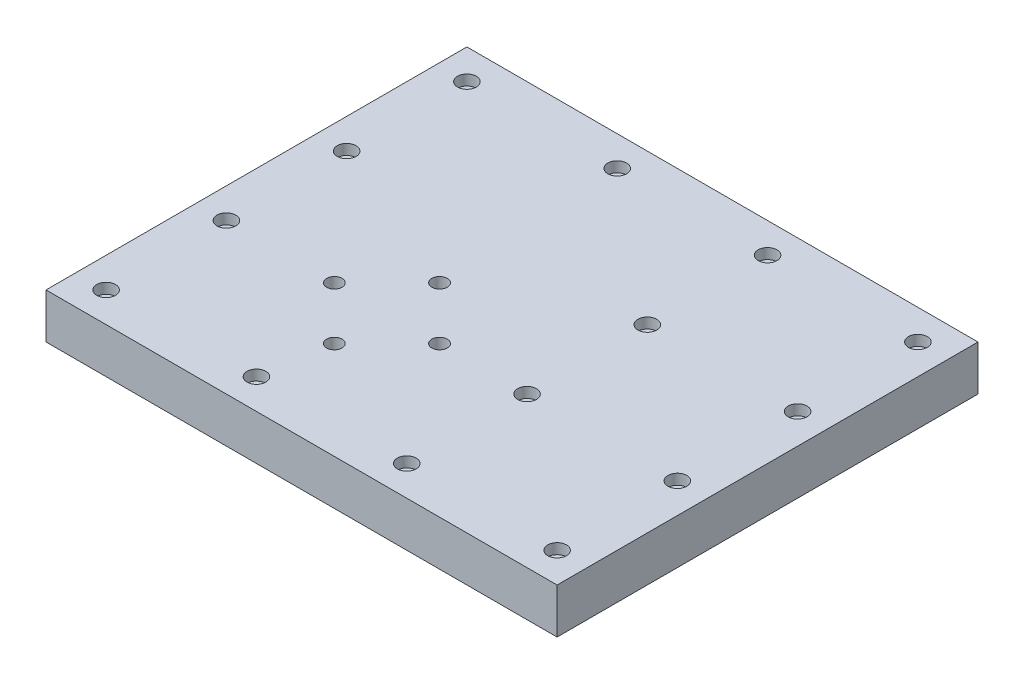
ISO-10303-21;
HEADER;
FILE_DESCRIPTION(('STEP AP214'),'2;1');
FILE_NAME('part.step','',(''),(''),'','','');
FILE_SCHEMA(('AUTOMOTIVE_DESIGN { 1 0 10303 214 1 1 1 1 }'));
ENDSEC;
DATA;
#1=APPLICATION_CONTEXT('core data for automotive mechanical design processes');
#2=APPLICATION_PROTOCOL_DEFINITION('international standard','automotive_design',2000,#1);
#3=PRODUCT_CONTEXT('',#1,'mechanical');
#4=PRODUCT('Part','Part','',(#3));
#5=PRODUCT_RELATED_PRODUCT_CATEGORY('part','',(#4));
#6=PRODUCT_DEFINITION_FORMATION('','',#4);
#7=PRODUCT_DEFINITION_CONTEXT('part definition',#1,'design');
#8=PRODUCT_DEFINITION('design','',#6,#7);
#9=PRODUCT_DEFINITION_SHAPE('','',#8);
#10=(LENGTH_UNIT() NAMED_UNIT(*) SI_UNIT(.MILLI.,.METRE.));
#11=(NAMED_UNIT(*) PLANE_ANGLE_UNIT() SI_UNIT($,.RADIAN.));
#12=(NAMED_UNIT(*) SI_UNIT($,.STERADIAN.) SOLID_ANGLE_UNIT());
#13=UNCERTAINTY_MEASURE_WITH_UNIT(LENGTH_MEASURE(1.E-05),#10,'distance_accuracy_value','');
#14=(GEOMETRIC_REPRESENTATION_CONTEXT(3) GLOBAL_UNCERTAINTY_ASSIGNED_CONTEXT((#13)) GLOBAL_UNIT_ASSIGNED_CONTEXT((#10,
#11,#12)) REPRESENTATION_CONTEXT('',''));
#15=CARTESIAN_POINT('',(0.,0.,0.));
#16=DIRECTION('',(0.,0.,1.));
#17=DIRECTION('',(1.,0.,0.));
#18=AXIS2_PLACEMENT_3D('',#15,#16,#17);
#19=CARTESIAN_POINT('',(107.95,19.05,-88.9));
#20=DIRECTION('',(-1.,0.,0.));
#21=DIRECTION('',(0.,0.,1.));
#22=AXIS2_PLACEMENT_3D('',#19,#20,#21);
#23=PLANE('',#22);
#24=DIRECTION('',(0.,0.,-1.));
#25=VECTOR('',#24,1.);
#26=CARTESIAN_POINT('',(107.95,0.,-88.9));
#27=LINE('',#26,#25);
#28=CARTESIAN_POINT('',(107.95,0.,88.9));
#29=VERTEX_POINT('',#28);
#30=CARTESIAN_POINT('',(107.95,0.,-88.9));
#31=VERTEX_POINT('',#30);
#32=EDGE_CURVE('E97',#29,#31,#27,.T.);
#33=ORIENTED_EDGE('',*,*,#32,.T.);
#34=DIRECTION('',(0.,-1.,0.));
#35=VECTOR('',#34,1.);
#36=CARTESIAN_POINT('',(107.95,19.05,-88.9));
#37=LINE('',#36,#35);
#38=CARTESIAN_POINT('',(107.95,19.05,-88.9));
#39=VERTEX_POINT('',#38);
#40=EDGE_CURVE('E11',#39,#31,#37,.T.);
#41=ORIENTED_EDGE('',*,*,#40,.F.);
#42=DIRECTION('',(0.,0.,-1.));
#43=VECTOR('',#42,1.);
#44=CARTESIAN_POINT('',(107.95,19.05,-88.9));
#45=LINE('',#44,#43);
#46=CARTESIAN_POINT('',(107.95,19.05,88.9));
#47=VERTEX_POINT('',#46);
#48=EDGE_CURVE('E85',#47,#39,#45,.T.);
#49=ORIENTED_EDGE('',*,*,#48,.F.);
#50=DIRECTION('',(0.,-1.,0.));
#51=VECTOR('',#50,1.);
#52=CARTESIAN_POINT('',(107.95,19.05,88.9));
#53=LINE('',#52,#51);
#54=EDGE_CURVE('E93',#47,#29,#53,.T.);
#55=ORIENTED_EDGE('',*,*,#54,.T.);
#56=EDGE_LOOP('',(#33,#41,#49,#55));
#57=FACE_BOUND('',#56,.T.);
#58=ADVANCED_FACE('F34',(#57),#23,.F.);
#59=CARTESIAN_POINT('',(-107.95,19.05,-88.9));
#60=DIRECTION('',(0.,0.,1.));
#61=DIRECTION('',(1.,0.,0.));
#62=AXIS2_PLACEMENT_3D('',#59,#60,#61);
#63=PLANE('',#62);
#64=DIRECTION('',(-1.,0.,0.));
#65=VECTOR('',#64,1.);
#66=CARTESIAN_POINT('',(-107.95,0.,-88.9));
#67=LINE('',#66,#65);
#68=CARTESIAN_POINT('',(-107.95,0.,-88.9));
#69=VERTEX_POINT('',#68);
#70=EDGE_CURVE('E89',#31,#69,#67,.T.);
#71=ORIENTED_EDGE('',*,*,#70,.T.);
#72=DIRECTION('',(0.,-1.,0.));
#73=VECTOR('',#72,1.);
#74=CARTESIAN_POINT('',(-107.95,19.05,-88.9));
#75=LINE('',#74,#73);
#76=CARTESIAN_POINT('',(-107.95,19.05,-88.9));
#77=VERTEX_POINT('',#76);
#78=EDGE_CURVE('E42',#77,#69,#75,.T.);
#79=ORIENTED_EDGE('',*,*,#78,.F.);
#80=DIRECTION('',(-1.,0.,0.));
#81=VECTOR('',#80,1.);
#82=CARTESIAN_POINT('',(-107.95,19.05,-88.9));
#83=LINE('',#82,#81);
#84=EDGE_CURVE('E80',#39,#77,#83,.T.);
#85=ORIENTED_EDGE('',*,*,#84,.F.);
#86=ORIENTED_EDGE('',*,*,#40,.T.);
#87=EDGE_LOOP('',(#71,#79,#85,#86));
#88=FACE_BOUND('',#87,.T.);
#89=ADVANCED_FACE('F88',(#88),#63,.F.);
#90=CARTESIAN_POINT('',(-107.95,19.05,-88.9));
#91=DIRECTION('',(1.,0.,0.));
#92=DIRECTION('',(0.,0.,-1.));
#93=AXIS2_PLACEMENT_3D('',#90,#91,#92);
#94=PLANE('',#93);
#95=DIRECTION('',(0.,0.,1.));
#96=VECTOR('',#95,1.);
#97=CARTESIAN_POINT('',(-107.95,0.,-88.9));
#98=LINE('',#97,#96);
#99=CARTESIAN_POINT('',(-107.95,0.,88.9));
#100=VERTEX_POINT('',#99);
#101=EDGE_CURVE('E67',#69,#100,#98,.T.);
#102=ORIENTED_EDGE('',*,*,#101,.T.);
#103=DIRECTION('',(0.,-1.,0.));
#104=VECTOR('',#103,1.);
#105=CARTESIAN_POINT('',(-107.95,19.05,88.9));
#106=LINE('',#105,#104);
#107=CARTESIAN_POINT('',(-107.95,19.05,88.9));
#108=VERTEX_POINT('',#107);
#109=EDGE_CURVE('E90',#108,#100,#106,.T.);
#110=ORIENTED_EDGE('',*,*,#109,.F.);
#111=DIRECTION('',(0.,0.,1.));
#112=VECTOR('',#111,1.);
#113=CARTESIAN_POINT('',(-107.95,19.05,-88.9));
#114=LINE('',#113,#112);
#115=EDGE_CURVE('E83',#77,#108,#114,.T.);
#116=ORIENTED_EDGE('',*,*,#115,.F.);
#117=ORIENTED_EDGE('',*,*,#78,.T.);
#118=EDGE_LOOP('',(#102,#110,#116,#117));
#119=FACE_BOUND('',#118,.T.);
#120=ADVANCED_FACE('F91',(#119),#94,.F.);
#121=CARTESIAN_POINT('',(-107.95,19.05,88.9));
#122=DIRECTION('',(0.,0.,-1.));
#123=DIRECTION('',(-1.,0.,0.));
#124=AXIS2_PLACEMENT_3D('',#121,#122,#123);
#125=PLANE('',#124);
#126=DIRECTION('',(1.,0.,0.));
#127=VECTOR('',#126,1.);
#128=CARTESIAN_POINT('',(-107.95,0.,88.9));
#129=LINE('',#128,#127);
#130=EDGE_CURVE('E73',#100,#29,#129,.T.);
#131=ORIENTED_EDGE('',*,*,#130,.T.);
#132=ORIENTED_EDGE('',*,*,#54,.F.);
#133=DIRECTION('',(1.,0.,0.));
#134=VECTOR('',#133,1.);
#135=CARTESIAN_POINT('',(-107.95,19.05,88.9));
#136=LINE('',#135,#134);
#137=EDGE_CURVE('E50',#108,#47,#136,.T.);
#138=ORIENTED_EDGE('',*,*,#137,.F.);
#139=ORIENTED_EDGE('',*,*,#109,.T.);
#140=EDGE_LOOP('',(#131,#132,#138,#139));
#141=FACE_BOUND('',#140,.T.);
#142=ADVANCED_FACE('F105',(#141),#125,.F.);
#143=CARTESIAN_POINT('',(0.,19.05,0.));
#144=DIRECTION('',(0.,1.,0.));
#145=DIRECTION('',(0.,0.,1.));
#146=AXIS2_PLACEMENT_3D('',#143,#144,#145);
#147=PLANE('',#146);
#148=CARTESIAN_POINT('',(-95.25,19.05,-76.2));
#149=DIRECTION('',(0.,1.,0.));
#150=DIRECTION('',(0.,0.,1.));
#151=AXIS2_PLACEMENT_3D('',#148,#149,#150);
#152=CIRCLE('',#151,3.96874999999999);
#153=CARTESIAN_POINT('',(-95.25,19.05,-72.23125));
#154=VERTEX_POINT('',#153);
#155=EDGE_CURVE('E299',#154,#154,#152,.T.);
#156=ORIENTED_EDGE('',*,*,#155,.F.);
#157=EDGE_LOOP('',(#156));
#158=FACE_BOUND('',#157,.T.);
#159=CARTESIAN_POINT('',(-95.2499999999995,19.05,-25.4));
#160=DIRECTION('',(0.,1.,0.));
#161=DIRECTION('',(0.,0.,1.));
#162=AXIS2_PLACEMENT_3D('',#159,#160,#161);
#163=CIRCLE('',#162,3.96874999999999);
#164=CARTESIAN_POINT('',(-95.2499999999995,19.05,-21.43125));
#165=VERTEX_POINT('',#164);
#166=EDGE_CURVE('E287',#165,#165,#163,.T.);
#167=ORIENTED_EDGE('',*,*,#166,.F.);
#168=EDGE_LOOP('',(#167));
#169=FACE_BOUND('',#168,.T.);
#170=CARTESIAN_POINT('',(-95.2499999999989,19.05,25.4));
#171=DIRECTION('',(0.,1.,0.));
#172=DIRECTION('',(0.,0.,1.));
#173=AXIS2_PLACEMENT_3D('',#170,#171,#172);
#174=CIRCLE('',#173,3.96874999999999);
#175=CARTESIAN_POINT('',(-95.2499999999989,19.05,29.36875));
#176=VERTEX_POINT('',#175);
#177=EDGE_CURVE('E275',#176,#176,#174,.T.);
#178=ORIENTED_EDGE('',*,*,#177,.F.);
#179=EDGE_LOOP('',(#178));
#180=FACE_BOUND('',#179,.T.);
#181=CARTESIAN_POINT('',(-95.2499999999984,19.05,76.2));
#182=DIRECTION('',(0.,1.,0.));
#183=DIRECTION('',(0.,0.,1.));
#184=AXIS2_PLACEMENT_3D('',#181,#182,#183);
#185=CIRCLE('',#184,3.96874999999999);
#186=CARTESIAN_POINT('',(-95.2499999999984,19.05,80.16875));
#187=VERTEX_POINT('',#186);
#188=EDGE_CURVE('E263',#187,#187,#185,.T.);
#189=ORIENTED_EDGE('',*,*,#188,.F.);
#190=EDGE_LOOP('',(#189));
#191=FACE_BOUND('',#190,.T.);
#192=CARTESIAN_POINT('',(-31.7499999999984,19.05,76.2));
#193=DIRECTION('',(0.,1.,0.));
#194=DIRECTION('',(0.,0.,1.));
#195=AXIS2_PLACEMENT_3D('',#192,#193,#194);
#196=CIRCLE('',#195,3.96875);
#197=CARTESIAN_POINT('',(-31.7499999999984,19.05,80.16875));
#198=VERTEX_POINT('',#197);
#199=EDGE_CURVE('E251',#198,#198,#196,.T.);
#200=ORIENTED_EDGE('',*,*,#199,.F.);
#201=EDGE_LOOP('',(#200));
#202=FACE_BOUND('',#201,.T.);
#203=CARTESIAN_POINT('',(-31.75,19.05,-76.2));
#204=DIRECTION('',(0.,1.,0.));
#205=DIRECTION('',(0.,0.,1.));
#206=AXIS2_PLACEMENT_3D('',#203,#204,#205);
#207=CIRCLE('',#206,3.96875);
#208=CARTESIAN_POINT('',(-31.75,19.05,-72.23125));
#209=VERTEX_POINT('',#208);
#210=EDGE_CURVE('E239',#209,#209,#207,.T.);
#211=ORIENTED_EDGE('',*,*,#210,.F.);
#212=EDGE_LOOP('',(#211));
#213=FACE_BOUND('',#212,.T.);
#214=CARTESIAN_POINT('',(31.75,19.05,-76.2));
#215=DIRECTION('',(0.,1.,0.));
#216=DIRECTION('',(0.,0.,1.));
#217=AXIS2_PLACEMENT_3D('',#214,#215,#216);
#218=CIRCLE('',#217,3.96874999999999);
#219=CARTESIAN_POINT('',(31.75,19.05,-72.23125));
#220=VERTEX_POINT('',#219);
#221=EDGE_CURVE('E227',#220,#220,#218,.T.);
#222=ORIENTED_EDGE('',*,*,#221,.F.);
#223=EDGE_LOOP('',(#222));
#224=FACE_BOUND('',#223,.T.);
#225=CARTESIAN_POINT('',(95.25,19.05,-76.2));
#226=DIRECTION('',(0.,1.,0.));
#227=DIRECTION('',(0.,0.,1.));
#228=AXIS2_PLACEMENT_3D('',#225,#226,#227);
#229=CIRCLE('',#228,3.96874999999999);
#230=CARTESIAN_POINT('',(95.25,19.05,-72.23125));
#231=VERTEX_POINT('',#230);
#232=EDGE_CURVE('E215',#231,#231,#229,.T.);
#233=ORIENTED_EDGE('',*,*,#232,.F.);
#234=EDGE_LOOP('',(#233));
#235=FACE_BOUND('',#234,.T.);
#236=CARTESIAN_POINT('',(31.7500000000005,19.05,-25.4));
#237=DIRECTION('',(0.,1.,0.));
#238=DIRECTION('',(0.,0.,1.));
#239=AXIS2_PLACEMENT_3D('',#236,#237,#238);
#240=CIRCLE('',#239,3.96874999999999);
#241=CARTESIAN_POINT('',(31.7500000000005,19.05,-21.43125));
#242=VERTEX_POINT('',#241);
#243=EDGE_CURVE('E203',#242,#242,#240,.T.);
#244=ORIENTED_EDGE('',*,*,#243,.F.);
#245=EDGE_LOOP('',(#244));
#246=FACE_BOUND('',#245,.T.);
#247=CARTESIAN_POINT('',(31.750000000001,19.05,25.4));
#248=DIRECTION('',(0.,1.,0.));
#249=DIRECTION('',(0.,0.,1.));
#250=AXIS2_PLACEMENT_3D('',#247,#248,#249);
#251=CIRCLE('',#250,3.96874999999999);
#252=CARTESIAN_POINT('',(31.750000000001,19.05,29.36875));
#253=VERTEX_POINT('',#252);
#254=EDGE_CURVE('E191',#253,#253,#251,.T.);
#255=ORIENTED_EDGE('',*,*,#254,.F.);
#256=EDGE_LOOP('',(#255));
#257=FACE_BOUND('',#256,.T.);
#258=CARTESIAN_POINT('',(31.7500000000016,19.05,76.2));
#259=DIRECTION('',(0.,1.,0.));
#260=DIRECTION('',(0.,0.,1.));
#261=AXIS2_PLACEMENT_3D('',#258,#259,#260);
#262=CIRCLE('',#261,3.96874999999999);
#263=CARTESIAN_POINT('',(31.7500000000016,19.05,80.16875));
#264=VERTEX_POINT('',#263);
#265=EDGE_CURVE('E179',#264,#264,#262,.T.);
#266=ORIENTED_EDGE('',*,*,#265,.F.);
#267=EDGE_LOOP('',(#266));
#268=FACE_BOUND('',#267,.T.);
#269=CARTESIAN_POINT('',(95.2500000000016,19.05,76.2));
#270=DIRECTION('',(0.,1.,0.));
#271=DIRECTION('',(0.,0.,1.));
#272=AXIS2_PLACEMENT_3D('',#269,#270,#271);
#273=CIRCLE('',#272,3.96874999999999);
#274=CARTESIAN_POINT('',(95.2500000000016,19.05,80.16875));
#275=VERTEX_POINT('',#274);
#276=EDGE_CURVE('E167',#275,#275,#273,.T.);
#277=ORIENTED_EDGE('',*,*,#276,.F.);
#278=EDGE_LOOP('',(#277));
#279=FACE_BOUND('',#278,.T.);
#280=CARTESIAN_POINT('',(95.2500000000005,19.05,-25.4));
#281=DIRECTION('',(0.,1.,0.));
#282=DIRECTION('',(0.,0.,1.));
#283=AXIS2_PLACEMENT_3D('',#280,#281,#282);
#284=CIRCLE('',#283,3.96874999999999);
#285=CARTESIAN_POINT('',(95.2500000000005,19.05,-21.43125));
#286=VERTEX_POINT('',#285);
#287=EDGE_CURVE('E155',#286,#286,#284,.T.);
#288=ORIENTED_EDGE('',*,*,#287,.F.);
#289=EDGE_LOOP('',(#288));
#290=FACE_BOUND('',#289,.T.);
#291=CARTESIAN_POINT('',(95.250000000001,19.05,25.4));
#292=DIRECTION('',(0.,1.,0.));
#293=DIRECTION('',(0.,0.,1.));
#294=AXIS2_PLACEMENT_3D('',#291,#292,#293);
#295=CIRCLE('',#294,3.96874999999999);
#296=CARTESIAN_POINT('',(95.250000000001,19.05,29.36875));
#297=VERTEX_POINT('',#296);
#298=EDGE_CURVE('E143',#297,#297,#295,.T.);
#299=ORIENTED_EDGE('',*,*,#298,.F.);
#300=EDGE_LOOP('',(#299));
#301=FACE_BOUND('',#300,.T.);
#302=CARTESIAN_POINT('',(-27.432,19.05,3.17499999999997));
#303=DIRECTION('',(0.,1.,0.));
#304=DIRECTION('',(0.,0.,1.));
#305=AXIS2_PLACEMENT_3D('',#302,#303,#304);
#306=CIRCLE('',#305,3.2639);
#307=CARTESIAN_POINT('',(-27.432,19.05,6.43889999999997));
#308=VERTEX_POINT('',#307);
#309=EDGE_CURVE('E100',#308,#308,#306,.T.);
#310=ORIENTED_EDGE('',*,*,#309,.F.);
#311=EDGE_LOOP('',(#310));
#312=FACE_BOUND('',#311,.T.);
#313=CARTESIAN_POINT('',(-49.657,19.05,25.4));
#314=DIRECTION('',(0.,1.,0.));
#315=DIRECTION('',(0.,0.,1.));
#316=AXIS2_PLACEMENT_3D('',#313,#314,#315);
#317=CIRCLE('',#316,3.2639);
#318=CARTESIAN_POINT('',(-49.657,19.05,28.6639));
#319=VERTEX_POINT('',#318);
#320=EDGE_CURVE('E113',#319,#319,#317,.T.);
#321=ORIENTED_EDGE('',*,*,#320,.F.);
#322=EDGE_LOOP('',(#321));
#323=FACE_BOUND('',#322,.T.);
#324=CARTESIAN_POINT('',(-27.432,19.05,47.625));
#325=DIRECTION('',(0.,1.,0.));
#326=DIRECTION('',(0.,0.,1.));
#327=AXIS2_PLACEMENT_3D('',#324,#325,#326);
#328=CIRCLE('',#327,3.2639);
#329=CARTESIAN_POINT('',(-27.432,19.05,50.8889));
#330=VERTEX_POINT('',#329);
#331=EDGE_CURVE('E116',#330,#330,#328,.T.);
#332=ORIENTED_EDGE('',*,*,#331,.F.);
#333=EDGE_LOOP('',(#332));
#334=FACE_BOUND('',#333,.T.);
#335=CARTESIAN_POINT('',(-5.20700000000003,19.05,25.4));
#336=DIRECTION('',(0.,1.,0.));
#337=DIRECTION('',(0.,0.,1.));
#338=AXIS2_PLACEMENT_3D('',#335,#336,#337);
#339=CIRCLE('',#338,3.2639);
#340=CARTESIAN_POINT('',(-5.20700000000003,19.05,28.6639));
#341=VERTEX_POINT('',#340);
#342=EDGE_CURVE('E119',#341,#341,#339,.T.);
#343=ORIENTED_EDGE('',*,*,#342,.F.);
#344=EDGE_LOOP('',(#343));
#345=FACE_BOUND('',#344,.T.);
#346=ORIENTED_EDGE('',*,*,#48,.T.);
#347=ORIENTED_EDGE('',*,*,#84,.T.);
#348=ORIENTED_EDGE('',*,*,#115,.T.);
#349=ORIENTED_EDGE('',*,*,#137,.T.);
#350=EDGE_LOOP('',(#346,#347,#348,#349));
#351=FACE_BOUND('',#350,.T.);
#352=ADVANCED_FACE('F81',(#158,#169,#180,#191,#202,#213,#224,#235,#246,#257,#268,#279,#290,#301,
#312,#323,#334,#345,#351),#147,.T.);
#353=CARTESIAN_POINT('',(0.,0.,0.));
#354=DIRECTION('',(0.,1.,0.));
#355=DIRECTION('',(0.,0.,1.));
#356=AXIS2_PLACEMENT_3D('',#353,#354,#355);
#357=PLANE('',#356);
#358=CARTESIAN_POINT('',(-95.25,0.,-76.2));
#359=DIRECTION('',(0.,1.,0.));
#360=DIRECTION('',(0.,0.,1.));
#361=AXIS2_PLACEMENT_3D('',#358,#359,#360);
#362=CIRCLE('',#361,2.15265000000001);
#363=CARTESIAN_POINT('',(-95.25,0.,-74.04735));
#364=VERTEX_POINT('',#363);
#365=EDGE_CURVE('E290',#364,#364,#362,.T.);
#366=ORIENTED_EDGE('',*,*,#365,.T.);
#367=EDGE_LOOP('',(#366));
#368=FACE_BOUND('',#367,.T.);
#369=CARTESIAN_POINT('',(-95.2499999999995,0.,-25.4));
#370=DIRECTION('',(0.,1.,0.));
#371=DIRECTION('',(0.,0.,1.));
#372=AXIS2_PLACEMENT_3D('',#369,#370,#371);
#373=CIRCLE('',#372,2.15265000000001);
#374=CARTESIAN_POINT('',(-95.2499999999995,0.,-23.24735));
#375=VERTEX_POINT('',#374);
#376=EDGE_CURVE('E278',#375,#375,#373,.T.);
#377=ORIENTED_EDGE('',*,*,#376,.T.);
#378=EDGE_LOOP('',(#377));
#379=FACE_BOUND('',#378,.T.);
#380=CARTESIAN_POINT('',(-95.2499999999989,0.,25.4));
#381=DIRECTION('',(0.,1.,0.));
#382=DIRECTION('',(0.,0.,1.));
#383=AXIS2_PLACEMENT_3D('',#380,#381,#382);
#384=CIRCLE('',#383,2.15265000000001);
#385=CARTESIAN_POINT('',(-95.2499999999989,0.,27.55265));
#386=VERTEX_POINT('',#385);
#387=EDGE_CURVE('E266',#386,#386,#384,.T.);
#388=ORIENTED_EDGE('',*,*,#387,.T.);
#389=EDGE_LOOP('',(#388));
#390=FACE_BOUND('',#389,.T.);
#391=CARTESIAN_POINT('',(-95.2499999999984,0.,76.2));
#392=DIRECTION('',(0.,1.,0.));
#393=DIRECTION('',(0.,0.,1.));
#394=AXIS2_PLACEMENT_3D('',#391,#392,#393);
#395=CIRCLE('',#394,2.15265000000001);
#396=CARTESIAN_POINT('',(-95.2499999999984,0.,78.35265));
#397=VERTEX_POINT('',#396);
#398=EDGE_CURVE('E254',#397,#397,#395,.T.);
#399=ORIENTED_EDGE('',*,*,#398,.T.);
#400=EDGE_LOOP('',(#399));
#401=FACE_BOUND('',#400,.T.);
#402=CARTESIAN_POINT('',(-31.7499999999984,0.,76.2));
#403=DIRECTION('',(0.,1.,0.));
#404=DIRECTION('',(0.,0.,1.));
#405=AXIS2_PLACEMENT_3D('',#402,#403,#404);
#406=CIRCLE('',#405,2.15265);
#407=CARTESIAN_POINT('',(-31.7499999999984,0.,78.35265));
#408=VERTEX_POINT('',#407);
#409=EDGE_CURVE('E242',#408,#408,#406,.T.);
#410=ORIENTED_EDGE('',*,*,#409,.T.);
#411=EDGE_LOOP('',(#410));
#412=FACE_BOUND('',#411,.T.);
#413=CARTESIAN_POINT('',(-31.75,0.,-76.2));
#414=DIRECTION('',(0.,1.,0.));
#415=DIRECTION('',(0.,0.,1.));
#416=AXIS2_PLACEMENT_3D('',#413,#414,#415);
#417=CIRCLE('',#416,2.15265);
#418=CARTESIAN_POINT('',(-31.75,0.,-74.04735));
#419=VERTEX_POINT('',#418);
#420=EDGE_CURVE('E230',#419,#419,#417,.T.);
#421=ORIENTED_EDGE('',*,*,#420,.T.);
#422=EDGE_LOOP('',(#421));
#423=FACE_BOUND('',#422,.T.);
#424=CARTESIAN_POINT('',(31.75,0.,-76.2));
#425=DIRECTION('',(0.,1.,0.));
#426=DIRECTION('',(0.,0.,1.));
#427=AXIS2_PLACEMENT_3D('',#424,#425,#426);
#428=CIRCLE('',#427,2.15265);
#429=CARTESIAN_POINT('',(31.75,0.,-74.04735));
#430=VERTEX_POINT('',#429);
#431=EDGE_CURVE('E218',#430,#430,#428,.T.);
#432=ORIENTED_EDGE('',*,*,#431,.T.);
#433=EDGE_LOOP('',(#432));
#434=FACE_BOUND('',#433,.T.);
#435=CARTESIAN_POINT('',(95.25,0.,-76.2));
#436=DIRECTION('',(0.,1.,0.));
#437=DIRECTION('',(0.,0.,1.));
#438=AXIS2_PLACEMENT_3D('',#435,#436,#437);
#439=CIRCLE('',#438,2.15265000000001);
#440=CARTESIAN_POINT('',(95.25,0.,-74.04735));
#441=VERTEX_POINT('',#440);
#442=EDGE_CURVE('E206',#441,#441,#439,.T.);
#443=ORIENTED_EDGE('',*,*,#442,.T.);
#444=EDGE_LOOP('',(#443));
#445=FACE_BOUND('',#444,.T.);
#446=CARTESIAN_POINT('',(31.7500000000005,0.,-25.4));
#447=DIRECTION('',(0.,1.,0.));
#448=DIRECTION('',(0.,0.,1.));
#449=AXIS2_PLACEMENT_3D('',#446,#447,#448);
#450=CIRCLE('',#449,2.15265);
#451=CARTESIAN_POINT('',(31.7500000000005,0.,-23.24735));
#452=VERTEX_POINT('',#451);
#453=EDGE_CURVE('E194',#452,#452,#450,.T.);
#454=ORIENTED_EDGE('',*,*,#453,.T.);
#455=EDGE_LOOP('',(#454));
#456=FACE_BOUND('',#455,.T.);
#457=CARTESIAN_POINT('',(31.750000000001,0.,25.4));
#458=DIRECTION('',(0.,1.,0.));
#459=DIRECTION('',(0.,0.,1.));
#460=AXIS2_PLACEMENT_3D('',#457,#458,#459);
#461=CIRCLE('',#460,2.15265);
#462=CARTESIAN_POINT('',(31.750000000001,0.,27.55265));
#463=VERTEX_POINT('',#462);
#464=EDGE_CURVE('E182',#463,#463,#461,.T.);
#465=ORIENTED_EDGE('',*,*,#464,.T.);
#466=EDGE_LOOP('',(#465));
#467=FACE_BOUND('',#466,.T.);
#468=CARTESIAN_POINT('',(31.7500000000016,0.,76.2));
#469=DIRECTION('',(0.,1.,0.));
#470=DIRECTION('',(0.,0.,1.));
#471=AXIS2_PLACEMENT_3D('',#468,#469,#470);
#472=CIRCLE('',#471,2.15265);
#473=CARTESIAN_POINT('',(31.7500000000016,0.,78.35265));
#474=VERTEX_POINT('',#473);
#475=EDGE_CURVE('E170',#474,#474,#472,.T.);
#476=ORIENTED_EDGE('',*,*,#475,.T.);
#477=EDGE_LOOP('',(#476));
#478=FACE_BOUND('',#477,.T.);
#479=CARTESIAN_POINT('',(95.2500000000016,0.,76.2));
#480=DIRECTION('',(0.,1.,0.));
#481=DIRECTION('',(0.,0.,1.));
#482=AXIS2_PLACEMENT_3D('',#479,#480,#481);
#483=CIRCLE('',#482,2.15265000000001);
#484=CARTESIAN_POINT('',(95.2500000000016,0.,78.35265));
#485=VERTEX_POINT('',#484);
#486=EDGE_CURVE('E158',#485,#485,#483,.T.);
#487=ORIENTED_EDGE('',*,*,#486,.T.);
#488=EDGE_LOOP('',(#487));
#489=FACE_BOUND('',#488,.T.);
#490=CARTESIAN_POINT('',(95.2500000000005,0.,-25.4));
#491=DIRECTION('',(0.,1.,0.));
#492=DIRECTION('',(0.,0.,1.));
#493=AXIS2_PLACEMENT_3D('',#490,#491,#492);
#494=CIRCLE('',#493,2.15265000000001);
#495=CARTESIAN_POINT('',(95.2500000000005,0.,-23.24735));
#496=VERTEX_POINT('',#495);
#497=EDGE_CURVE('E146',#496,#496,#494,.T.);
#498=ORIENTED_EDGE('',*,*,#497,.T.);
#499=EDGE_LOOP('',(#498));
#500=FACE_BOUND('',#499,.T.);
#501=CARTESIAN_POINT('',(95.250000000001,0.,25.4));
#502=DIRECTION('',(0.,1.,0.));
#503=DIRECTION('',(0.,0.,1.));
#504=AXIS2_PLACEMENT_3D('',#501,#502,#503);
#505=CIRCLE('',#504,2.15265000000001);
#506=CARTESIAN_POINT('',(95.250000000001,0.,27.55265));
#507=VERTEX_POINT('',#506);
#508=EDGE_CURVE('E127',#507,#507,#505,.T.);
#509=ORIENTED_EDGE('',*,*,#508,.T.);
#510=EDGE_LOOP('',(#509));
#511=FACE_BOUND('',#510,.T.);
#512=CARTESIAN_POINT('',(-27.432,0.,3.17499999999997));
#513=DIRECTION('',(0.,1.,0.));
#514=DIRECTION('',(0.,0.,1.));
#515=AXIS2_PLACEMENT_3D('',#512,#513,#514);
#516=CIRCLE('',#515,3.2639);
#517=CARTESIAN_POINT('',(-27.432,0.,6.43889999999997));
#518=VERTEX_POINT('',#517);
#519=EDGE_CURVE('E122',#518,#518,#516,.T.);
#520=ORIENTED_EDGE('',*,*,#519,.T.);
#521=EDGE_LOOP('',(#520));
#522=FACE_BOUND('',#521,.T.);
#523=CARTESIAN_POINT('',(-49.657,0.,25.4));
#524=DIRECTION('',(0.,1.,0.));
#525=DIRECTION('',(0.,0.,1.));
#526=AXIS2_PLACEMENT_3D('',#523,#524,#525);
#527=CIRCLE('',#526,3.2639);
#528=CARTESIAN_POINT('',(-49.657,0.,28.6639));
#529=VERTEX_POINT('',#528);
#530=EDGE_CURVE('E130',#529,#529,#527,.T.);
#531=ORIENTED_EDGE('',*,*,#530,.T.);
#532=EDGE_LOOP('',(#531));
#533=FACE_BOUND('',#532,.T.);
#534=CARTESIAN_POINT('',(-27.432,0.,47.625));
#535=DIRECTION('',(0.,1.,0.));
#536=DIRECTION('',(0.,0.,1.));
#537=AXIS2_PLACEMENT_3D('',#534,#535,#536);
#538=CIRCLE('',#537,3.2639);
#539=CARTESIAN_POINT('',(-27.432,0.,50.8889));
#540=VERTEX_POINT('',#539);
#541=EDGE_CURVE('E126',#540,#540,#538,.T.);
#542=ORIENTED_EDGE('',*,*,#541,.T.);
#543=EDGE_LOOP('',(#542));
#544=FACE_BOUND('',#543,.T.);
#545=CARTESIAN_POINT('',(-5.20700000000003,0.,25.4));
#546=DIRECTION('',(0.,1.,0.));
#547=DIRECTION('',(0.,0.,1.));
#548=AXIS2_PLACEMENT_3D('',#545,#546,#547);
#549=CIRCLE('',#548,3.2639);
#550=CARTESIAN_POINT('',(-5.20700000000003,0.,28.6639));
#551=VERTEX_POINT('',#550);
#552=EDGE_CURVE('E123',#551,#551,#549,.T.);
#553=ORIENTED_EDGE('',*,*,#552,.T.);
#554=EDGE_LOOP('',(#553));
#555=FACE_BOUND('',#554,.T.);
#556=ORIENTED_EDGE('',*,*,#32,.F.);
#557=ORIENTED_EDGE('',*,*,#130,.F.);
#558=ORIENTED_EDGE('',*,*,#101,.F.);
#559=ORIENTED_EDGE('',*,*,#70,.F.);
#560=EDGE_LOOP('',(#556,#557,#558,#559));
#561=FACE_BOUND('',#560,.T.);
#562=ADVANCED_FACE('F108',(#368,#379,#390,#401,#412,#423,#434,#445,#456,#467,#478,#489,#500,
#511,#522,#533,#544,#555,#561),#357,.F.);
#563=CARTESIAN_POINT('',(-5.20700000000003,0.,25.4));
#564=DIRECTION('',(0.,1.,0.));
#565=DIRECTION('',(0.,0.,1.));
#566=AXIS2_PLACEMENT_3D('',#563,#564,#565);
#567=CYLINDRICAL_SURFACE('',#566,3.2639);
#568=CARTESIAN_POINT('',(-5.20700000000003,19.05,28.6639));
#569=CARTESIAN_POINT('',(-5.20700000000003,18.8515625,28.6639));
#570=CARTESIAN_POINT('',(-5.20700000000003,18.653125,28.6639));
#571=CARTESIAN_POINT('',(-5.20700000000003,18.25625,28.6639));
#572=CARTESIAN_POINT('',(-5.20700000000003,18.0578125,28.6639));
#573=CARTESIAN_POINT('',(-5.20700000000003,17.6609375,28.6639));
#574=CARTESIAN_POINT('',(-5.20700000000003,17.4625,28.6639));
#575=CARTESIAN_POINT('',(-5.20700000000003,17.065625,28.6639));
#576=CARTESIAN_POINT('',(-5.20700000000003,16.8671875,28.6639));
#577=CARTESIAN_POINT('',(-5.20700000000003,16.4703125,28.6639));
#578=CARTESIAN_POINT('',(-5.20700000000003,16.271875,28.6639));
#579=CARTESIAN_POINT('',(-5.20700000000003,15.875,28.6639));
#580=CARTESIAN_POINT('',(-5.20700000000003,15.6765625,28.6639));
#581=CARTESIAN_POINT('',(-5.20700000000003,15.2796875,28.6639));
#582=CARTESIAN_POINT('',(-5.20700000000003,15.08125,28.6639));
#583=CARTESIAN_POINT('',(-5.20700000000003,14.684375,28.6639));
#584=CARTESIAN_POINT('',(-5.20700000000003,14.4859375,28.6639));
#585=CARTESIAN_POINT('',(-5.20700000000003,14.0890625,28.6639));
#586=CARTESIAN_POINT('',(-5.20700000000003,13.890625,28.6639));
#587=CARTESIAN_POINT('',(-5.20700000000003,13.49375,28.6639));
#588=CARTESIAN_POINT('',(-5.20700000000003,13.2953125,28.6639));
#589=CARTESIAN_POINT('',(-5.20700000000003,12.8984375,28.6639));
#590=CARTESIAN_POINT('',(-5.20700000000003,12.7,28.6639));
#591=CARTESIAN_POINT('',(-5.20700000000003,12.303125,28.6639));
#592=CARTESIAN_POINT('',(-5.20700000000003,12.1046875,28.6639));
#593=CARTESIAN_POINT('',(-5.20700000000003,11.7078125,28.6639));
#594=CARTESIAN_POINT('',(-5.20700000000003,11.509375,28.6639));
#595=CARTESIAN_POINT('',(-5.20700000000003,11.1125,28.6639));
#596=CARTESIAN_POINT('',(-5.20700000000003,10.9140625,28.6639));
#597=CARTESIAN_POINT('',(-5.20700000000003,10.5171875,28.6639));
#598=CARTESIAN_POINT('',(-5.20700000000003,10.31875,28.6639));
#599=CARTESIAN_POINT('',(-5.20700000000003,9.921875,28.6639));
#600=CARTESIAN_POINT('',(-5.20700000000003,9.7234375,28.6639));
#601=CARTESIAN_POINT('',(-5.20700000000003,9.3265625,28.6639));
#602=CARTESIAN_POINT('',(-5.20700000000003,9.128125,28.6639));
#603=CARTESIAN_POINT('',(-5.20700000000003,8.73125,28.6639));
#604=CARTESIAN_POINT('',(-5.20700000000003,8.5328125,28.6639));
#605=CARTESIAN_POINT('',(-5.20700000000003,8.1359375,28.6639));
#606=CARTESIAN_POINT('',(-5.20700000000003,7.9375,28.6639));
#607=CARTESIAN_POINT('',(-5.20700000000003,7.540625,28.6639));
#608=CARTESIAN_POINT('',(-5.20700000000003,7.3421875,28.6639));
#609=CARTESIAN_POINT('',(-5.20700000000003,6.9453125,28.6639));
#610=CARTESIAN_POINT('',(-5.20700000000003,6.746875,28.6639));
#611=CARTESIAN_POINT('',(-5.20700000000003,6.35,28.6639));
#612=CARTESIAN_POINT('',(-5.20700000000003,6.1515625,28.6639));
#613=CARTESIAN_POINT('',(-5.20700000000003,5.7546875,28.6639));
#614=CARTESIAN_POINT('',(-5.20700000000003,5.55625,28.6639));
#615=CARTESIAN_POINT('',(-5.20700000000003,5.159375,28.6639));
#616=CARTESIAN_POINT('',(-5.20700000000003,4.9609375,28.6639));
#617=CARTESIAN_POINT('',(-5.20700000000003,4.5640625,28.6639));
#618=CARTESIAN_POINT('',(-5.20700000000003,4.365625,28.6639));
#619=CARTESIAN_POINT('',(-5.20700000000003,3.96875,28.6639));
#620=CARTESIAN_POINT('',(-5.20700000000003,3.7703125,28.6639));
#621=CARTESIAN_POINT('',(-5.20700000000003,3.3734375,28.6639));
#622=CARTESIAN_POINT('',(-5.20700000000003,3.175,28.6639));
#623=CARTESIAN_POINT('',(-5.20700000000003,2.778125,28.6639));
#624=CARTESIAN_POINT('',(-5.20700000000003,2.5796875,28.6639));
#625=CARTESIAN_POINT('',(-5.20700000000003,2.1828125,28.6639));
#626=CARTESIAN_POINT('',(-5.20700000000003,1.984375,28.6639));
#627=CARTESIAN_POINT('',(-5.20700000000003,1.5875,28.6639));
#628=CARTESIAN_POINT('',(-5.20700000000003,1.3890625,28.6639));
#629=CARTESIAN_POINT('',(-5.20700000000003,0.9921875,28.6639));
#630=CARTESIAN_POINT('',(-5.20700000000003,0.79375,28.6639));
#631=CARTESIAN_POINT('',(-5.20700000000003,0.396875,28.6639));
#632=CARTESIAN_POINT('',(-5.20700000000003,0.1984375,28.6639));
#633=CARTESIAN_POINT('',(-5.20700000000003,0.,28.6639));
#634=B_SPLINE_CURVE_WITH_KNOTS('',3,(#568,#569,#570,#571,#572,#573,#574,#575,#576,#577,#578,
#579,#580,#581,#582,#583,#584,#585,#586,#587,#588,#589,#590,#591,#592,#593,#594,#595,#596,#597,
#598,#599,#600,#601,#602,#603,#604,#605,#606,#607,#608,#609,#610,#611,#612,#613,#614,#615,#616,
#617,#618,#619,#620,#621,#622,#623,#624,#625,#626,#627,#628,#629,#630,#631,#632,#633),
.UNSPECIFIED.,.F.,.F.,(4,2,2,2,2,2,2,2,2,2,2,2,2,2,2,2,2,2,2,2,2,2,2,2,2,2,2,2,2,2,2,2,4),(0.,
0.5953125,1.190625,1.7859375,2.38125,2.9765625,3.571875,4.1671875,4.7625,5.3578125,5.953125,
6.5484375,7.14375,7.7390625,8.334375,8.9296875,9.525,10.1203125,10.715625,11.3109375,11.90625,
12.5015625,13.096875,13.6921875,14.2875,14.8828125,15.478125,16.0734375,16.66875,17.2640625,
17.859375,18.4546875,19.05),.UNSPECIFIED.);
#635=EDGE_CURVE('BSEAM342',#341,#551,#634,.T.);
#636=ORIENTED_EDGE('',*,*,#342,.T.);
#637=ORIENTED_EDGE('',*,*,#552,.F.);
#638=ORIENTED_EDGE('',*,*,#635,.T.);
#639=ORIENTED_EDGE('',*,*,#635,.F.);
#640=EDGE_LOOP('',(#636,#638,#637,#639));
#641=FACE_BOUND('',#640,.T.);
#642=ADVANCED_FACE('F342',(#641),#567,.F.);
#643=CARTESIAN_POINT('',(-27.432,0.,47.625));
#644=DIRECTION('',(0.,1.,0.));
#645=DIRECTION('',(0.,0.,1.));
#646=AXIS2_PLACEMENT_3D('',#643,#644,#645);
#647=CYLINDRICAL_SURFACE('',#646,3.2639);
#648=CARTESIAN_POINT('',(-27.432,19.05,50.8889));
#649=CARTESIAN_POINT('',(-27.432,18.8515625,50.8889));
#650=CARTESIAN_POINT('',(-27.432,18.653125,50.8889));
#651=CARTESIAN_POINT('',(-27.432,18.25625,50.8889));
#652=CARTESIAN_POINT('',(-27.432,18.0578125,50.8889));
#653=CARTESIAN_POINT('',(-27.432,17.6609375,50.8889));
#654=CARTESIAN_POINT('',(-27.432,17.4625,50.8889));
#655=CARTESIAN_POINT('',(-27.432,17.065625,50.8889));
#656=CARTESIAN_POINT('',(-27.432,16.8671875,50.8889));
#657=CARTESIAN_POINT('',(-27.432,16.4703125,50.8889));
#658=CARTESIAN_POINT('',(-27.432,16.271875,50.8889));
#659=CARTESIAN_POINT('',(-27.432,15.875,50.8889));
#660=CARTESIAN_POINT('',(-27.432,15.6765625,50.8889));
#661=CARTESIAN_POINT('',(-27.432,15.2796875,50.8889));
#662=CARTESIAN_POINT('',(-27.432,15.08125,50.8889));
#663=CARTESIAN_POINT('',(-27.432,14.684375,50.8889));
#664=CARTESIAN_POINT('',(-27.432,14.4859375,50.8889));
#665=CARTESIAN_POINT('',(-27.432,14.0890625,50.8889));
#666=CARTESIAN_POINT('',(-27.432,13.890625,50.8889));
#667=CARTESIAN_POINT('',(-27.432,13.49375,50.8889));
#668=CARTESIAN_POINT('',(-27.432,13.2953125,50.8889));
#669=CARTESIAN_POINT('',(-27.432,12.8984375,50.8889));
#670=CARTESIAN_POINT('',(-27.432,12.7,50.8889));
#671=CARTESIAN_POINT('',(-27.432,12.303125,50.8889));
#672=CARTESIAN_POINT('',(-27.432,12.1046875,50.8889));
#673=CARTESIAN_POINT('',(-27.432,11.7078125,50.8889));
#674=CARTESIAN_POINT('',(-27.432,11.509375,50.8889));
#675=CARTESIAN_POINT('',(-27.432,11.1125,50.8889));
#676=CARTESIAN_POINT('',(-27.432,10.9140625,50.8889));
#677=CARTESIAN_POINT('',(-27.432,10.5171875,50.8889));
#678=CARTESIAN_POINT('',(-27.432,10.31875,50.8889));
#679=CARTESIAN_POINT('',(-27.432,9.921875,50.8889));
#680=CARTESIAN_POINT('',(-27.432,9.7234375,50.8889));
#681=CARTESIAN_POINT('',(-27.432,9.3265625,50.8889));
#682=CARTESIAN_POINT('',(-27.432,9.128125,50.8889));
#683=CARTESIAN_POINT('',(-27.432,8.73125,50.8889));
#684=CARTESIAN_POINT('',(-27.432,8.5328125,50.8889));
#685=CARTESIAN_POINT('',(-27.432,8.1359375,50.8889));
#686=CARTESIAN_POINT('',(-27.432,7.9375,50.8889));
#687=CARTESIAN_POINT('',(-27.432,7.540625,50.8889));
#688=CARTESIAN_POINT('',(-27.432,7.3421875,50.8889));
#689=CARTESIAN_POINT('',(-27.432,6.9453125,50.8889));
#690=CARTESIAN_POINT('',(-27.432,6.746875,50.8889));
#691=CARTESIAN_POINT('',(-27.432,6.35,50.8889));
#692=CARTESIAN_POINT('',(-27.432,6.1515625,50.8889));
#693=CARTESIAN_POINT('',(-27.432,5.7546875,50.8889));
#694=CARTESIAN_POINT('',(-27.432,5.55625,50.8889));
#695=CARTESIAN_POINT('',(-27.432,5.159375,50.8889));
#696=CARTESIAN_POINT('',(-27.432,4.9609375,50.8889));
#697=CARTESIAN_POINT('',(-27.432,4.5640625,50.8889));
#698=CARTESIAN_POINT('',(-27.432,4.365625,50.8889));
#699=CARTESIAN_POINT('',(-27.432,3.96875,50.8889));
#700=CARTESIAN_POINT('',(-27.432,3.7703125,50.8889));
#701=CARTESIAN_POINT('',(-27.432,3.3734375,50.8889));
#702=CARTESIAN_POINT('',(-27.432,3.175,50.8889));
#703=CARTESIAN_POINT('',(-27.432,2.778125,50.8889));
#704=CARTESIAN_POINT('',(-27.432,2.5796875,50.8889));
#705=CARTESIAN_POINT('',(-27.432,2.1828125,50.8889));
#706=CARTESIAN_POINT('',(-27.432,1.984375,50.8889));
#707=CARTESIAN_POINT('',(-27.432,1.5875,50.8889));
#708=CARTESIAN_POINT('',(-27.432,1.3890625,50.8889));
#709=CARTESIAN_POINT('',(-27.432,0.9921875,50.8889));
#710=CARTESIAN_POINT('',(-27.432,0.79375,50.8889));
#711=CARTESIAN_POINT('',(-27.432,0.396875,50.8889));
#712=CARTESIAN_POINT('',(-27.432,0.1984375,50.8889));
#713=CARTESIAN_POINT('',(-27.432,0.,50.8889));
#714=B_SPLINE_CURVE_WITH_KNOTS('',3,(#648,#649,#650,#651,#652,#653,#654,#655,#656,#657,#658,
#659,#660,#661,#662,#663,#664,#665,#666,#667,#668,#669,#670,#671,#672,#673,#674,#675,#676,#677,
#678,#679,#680,#681,#682,#683,#684,#685,#686,#687,#688,#689,#690,#691,#692,#693,#694,#695,#696,
#697,#698,#699,#700,#701,#702,#703,#704,#705,#706,#707,#708,#709,#710,#711,#712,#713),
.UNSPECIFIED.,.F.,.F.,(4,2,2,2,2,2,2,2,2,2,2,2,2,2,2,2,2,2,2,2,2,2,2,2,2,2,2,2,2,2,2,2,4),(0.,
0.5953125,1.190625,1.7859375,2.38125,2.9765625,3.571875,4.1671875,4.7625,5.3578125,5.953125,
6.5484375,7.14375,7.7390625,8.334375,8.9296875,9.525,10.1203125,10.715625,11.3109375,11.90625,
12.5015625,13.096875,13.6921875,14.2875,14.8828125,15.478125,16.0734375,16.66875,17.2640625,
17.859375,18.4546875,19.05),.UNSPECIFIED.);
#715=EDGE_CURVE('BSEAM345',#330,#540,#714,.T.);
#716=ORIENTED_EDGE('',*,*,#331,.T.);
#717=ORIENTED_EDGE('',*,*,#541,.F.);
#718=ORIENTED_EDGE('',*,*,#715,.T.);
#719=ORIENTED_EDGE('',*,*,#715,.F.);
#720=EDGE_LOOP('',(#716,#718,#717,#719));
#721=FACE_BOUND('',#720,.T.);
#722=ADVANCED_FACE('F345',(#721),#647,.F.);
#723=CARTESIAN_POINT('',(-49.657,0.,25.4));
#724=DIRECTION('',(0.,1.,0.));
#725=DIRECTION('',(0.,0.,1.));
#726=AXIS2_PLACEMENT_3D('',#723,#724,#725);
#727=CYLINDRICAL_SURFACE('',#726,3.2639);
#728=CARTESIAN_POINT('',(-49.657,19.05,28.6639));
#729=CARTESIAN_POINT('',(-49.657,18.8515625,28.6639));
#730=CARTESIAN_POINT('',(-49.657,18.653125,28.6639));
#731=CARTESIAN_POINT('',(-49.657,18.25625,28.6639));
#732=CARTESIAN_POINT('',(-49.657,18.0578125,28.6639));
#733=CARTESIAN_POINT('',(-49.657,17.6609375,28.6639));
#734=CARTESIAN_POINT('',(-49.657,17.4625,28.6639));
#735=CARTESIAN_POINT('',(-49.657,17.065625,28.6639));
#736=CARTESIAN_POINT('',(-49.657,16.8671875,28.6639));
#737=CARTESIAN_POINT('',(-49.657,16.4703125,28.6639));
#738=CARTESIAN_POINT('',(-49.657,16.271875,28.6639));
#739=CARTESIAN_POINT('',(-49.657,15.875,28.6639));
#740=CARTESIAN_POINT('',(-49.657,15.6765625,28.6639));
#741=CARTESIAN_POINT('',(-49.657,15.2796875,28.6639));
#742=CARTESIAN_POINT('',(-49.657,15.08125,28.6639));
#743=CARTESIAN_POINT('',(-49.657,14.684375,28.6639));
#744=CARTESIAN_POINT('',(-49.657,14.4859375,28.6639));
#745=CARTESIAN_POINT('',(-49.657,14.0890625,28.6639));
#746=CARTESIAN_POINT('',(-49.657,13.890625,28.6639));
#747=CARTESIAN_POINT('',(-49.657,13.49375,28.6639));
#748=CARTESIAN_POINT('',(-49.657,13.2953125,28.6639));
#749=CARTESIAN_POINT('',(-49.657,12.8984375,28.6639));
#750=CARTESIAN_POINT('',(-49.657,12.7,28.6639));
#751=CARTESIAN_POINT('',(-49.657,12.303125,28.6639));
#752=CARTESIAN_POINT('',(-49.657,12.1046875,28.6639));
#753=CARTESIAN_POINT('',(-49.657,11.7078125,28.6639));
#754=CARTESIAN_POINT('',(-49.657,11.509375,28.6639));
#755=CARTESIAN_POINT('',(-49.657,11.1125,28.6639));
#756=CARTESIAN_POINT('',(-49.657,10.9140625,28.6639));
#757=CARTESIAN_POINT('',(-49.657,10.5171875,28.6639));
#758=CARTESIAN_POINT('',(-49.657,10.31875,28.6639));
#759=CARTESIAN_POINT('',(-49.657,9.921875,28.6639));
#760=CARTESIAN_POINT('',(-49.657,9.7234375,28.6639));
#761=CARTESIAN_POINT('',(-49.657,9.3265625,28.6639));
#762=CARTESIAN_POINT('',(-49.657,9.128125,28.6639));
#763=CARTESIAN_POINT('',(-49.657,8.73125,28.6639));
#764=CARTESIAN_POINT('',(-49.657,8.5328125,28.6639));
#765=CARTESIAN_POINT('',(-49.657,8.1359375,28.6639));
#766=CARTESIAN_POINT('',(-49.657,7.9375,28.6639));
#767=CARTESIAN_POINT('',(-49.657,7.540625,28.6639));
#768=CARTESIAN_POINT('',(-49.657,7.3421875,28.6639));
#769=CARTESIAN_POINT('',(-49.657,6.9453125,28.6639));
#770=CARTESIAN_POINT('',(-49.657,6.746875,28.6639));
#771=CARTESIAN_POINT('',(-49.657,6.35,28.6639));
#772=CARTESIAN_POINT('',(-49.657,6.1515625,28.6639));
#773=CARTESIAN_POINT('',(-49.657,5.7546875,28.6639));
#774=CARTESIAN_POINT('',(-49.657,5.55625,28.6639));
#775=CARTESIAN_POINT('',(-49.657,5.159375,28.6639));
#776=CARTESIAN_POINT('',(-49.657,4.9609375,28.6639));
#777=CARTESIAN_POINT('',(-49.657,4.5640625,28.6639));
#778=CARTESIAN_POINT('',(-49.657,4.365625,28.6639));
#779=CARTESIAN_POINT('',(-49.657,3.96875,28.6639));
#780=CARTESIAN_POINT('',(-49.657,3.7703125,28.6639));
#781=CARTESIAN_POINT('',(-49.657,3.3734375,28.6639));
#782=CARTESIAN_POINT('',(-49.657,3.175,28.6639));
#783=CARTESIAN_POINT('',(-49.657,2.778125,28.6639));
#784=CARTESIAN_POINT('',(-49.657,2.5796875,28.6639));
#785=CARTESIAN_POINT('',(-49.657,2.1828125,28.6639));
#786=CARTESIAN_POINT('',(-49.657,1.984375,28.6639));
#787=CARTESIAN_POINT('',(-49.657,1.5875,28.6639));
#788=CARTESIAN_POINT('',(-49.657,1.3890625,28.6639));
#789=CARTESIAN_POINT('',(-49.657,0.9921875,28.6639));
#790=CARTESIAN_POINT('',(-49.657,0.79375,28.6639));
#791=CARTESIAN_POINT('',(-49.657,0.396875,28.6639));
#792=CARTESIAN_POINT('',(-49.657,0.1984375,28.6639));
#793=CARTESIAN_POINT('',(-49.657,0.,28.6639));
#794=B_SPLINE_CURVE_WITH_KNOTS('',3,(#728,#729,#730,#731,#732,#733,#734,#735,#736,#737,#738,
#739,#740,#741,#742,#743,#744,#745,#746,#747,#748,#749,#750,#751,#752,#753,#754,#755,#756,#757,
#758,#759,#760,#761,#762,#763,#764,#765,#766,#767,#768,#769,#770,#771,#772,#773,#774,#775,#776,
#777,#778,#779,#780,#781,#782,#783,#784,#785,#786,#787,#788,#789,#790,#791,#792,#793),
.UNSPECIFIED.,.F.,.F.,(4,2,2,2,2,2,2,2,2,2,2,2,2,2,2,2,2,2,2,2,2,2,2,2,2,2,2,2,2,2,2,2,4),(0.,
0.5953125,1.190625,1.7859375,2.38125,2.9765625,3.571875,4.1671875,4.7625,5.3578125,5.953125,
6.5484375,7.14375,7.7390625,8.334375,8.9296875,9.525,10.1203125,10.715625,11.3109375,11.90625,
12.5015625,13.096875,13.6921875,14.2875,14.8828125,15.478125,16.0734375,16.66875,17.2640625,
17.859375,18.4546875,19.05),.UNSPECIFIED.);
#795=EDGE_CURVE('BSEAM811',#319,#529,#794,.T.);
#796=ORIENTED_EDGE('',*,*,#320,.T.);
#797=ORIENTED_EDGE('',*,*,#530,.F.);
#798=ORIENTED_EDGE('',*,*,#795,.T.);
#799=ORIENTED_EDGE('',*,*,#795,.F.);
#800=EDGE_LOOP('',(#796,#798,#797,#799));
#801=FACE_BOUND('',#800,.T.);
#802=ADVANCED_FACE('F811',(#801),#727,.F.);
#803=CARTESIAN_POINT('',(-27.432,0.,3.17499999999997));
#804=DIRECTION('',(0.,1.,0.));
#805=DIRECTION('',(0.,0.,1.));
#806=AXIS2_PLACEMENT_3D('',#803,#804,#805);
#807=CYLINDRICAL_SURFACE('',#806,3.2639);
#808=CARTESIAN_POINT('',(-27.432,19.05,6.43889999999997));
#809=CARTESIAN_POINT('',(-27.432,18.8515625,6.43889999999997));
#810=CARTESIAN_POINT('',(-27.432,18.653125,6.43889999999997));
#811=CARTESIAN_POINT('',(-27.432,18.25625,6.43889999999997));
#812=CARTESIAN_POINT('',(-27.432,18.0578125,6.43889999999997));
#813=CARTESIAN_POINT('',(-27.432,17.6609375,6.43889999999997));
#814=CARTESIAN_POINT('',(-27.432,17.4625,6.43889999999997));
#815=CARTESIAN_POINT('',(-27.432,17.065625,6.43889999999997));
#816=CARTESIAN_POINT('',(-27.432,16.8671875,6.43889999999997));
#817=CARTESIAN_POINT('',(-27.432,16.4703125,6.43889999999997));
#818=CARTESIAN_POINT('',(-27.432,16.271875,6.43889999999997));
#819=CARTESIAN_POINT('',(-27.432,15.875,6.43889999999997));
#820=CARTESIAN_POINT('',(-27.432,15.6765625,6.43889999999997));
#821=CARTESIAN_POINT('',(-27.432,15.2796875,6.43889999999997));
#822=CARTESIAN_POINT('',(-27.432,15.08125,6.43889999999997));
#823=CARTESIAN_POINT('',(-27.432,14.684375,6.43889999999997));
#824=CARTESIAN_POINT('',(-27.432,14.4859375,6.43889999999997));
#825=CARTESIAN_POINT('',(-27.432,14.0890625,6.43889999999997));
#826=CARTESIAN_POINT('',(-27.432,13.890625,6.43889999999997));
#827=CARTESIAN_POINT('',(-27.432,13.49375,6.43889999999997));
#828=CARTESIAN_POINT('',(-27.432,13.2953125,6.43889999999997));
#829=CARTESIAN_POINT('',(-27.432,12.8984375,6.43889999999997));
#830=CARTESIAN_POINT('',(-27.432,12.7,6.43889999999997));
#831=CARTESIAN_POINT('',(-27.432,12.303125,6.43889999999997));
#832=CARTESIAN_POINT('',(-27.432,12.1046875,6.43889999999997));
#833=CARTESIAN_POINT('',(-27.432,11.7078125,6.43889999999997));
#834=CARTESIAN_POINT('',(-27.432,11.509375,6.43889999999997));
#835=CARTESIAN_POINT('',(-27.432,11.1125,6.43889999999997));
#836=CARTESIAN_POINT('',(-27.432,10.9140625,6.43889999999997));
#837=CARTESIAN_POINT('',(-27.432,10.5171875,6.43889999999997));
#838=CARTESIAN_POINT('',(-27.432,10.31875,6.43889999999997));
#839=CARTESIAN_POINT('',(-27.432,9.921875,6.43889999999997));
#840=CARTESIAN_POINT('',(-27.432,9.7234375,6.43889999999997));
#841=CARTESIAN_POINT('',(-27.432,9.3265625,6.43889999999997));
#842=CARTESIAN_POINT('',(-27.432,9.128125,6.43889999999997));
#843=CARTESIAN_POINT('',(-27.432,8.73125,6.43889999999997));
#844=CARTESIAN_POINT('',(-27.432,8.5328125,6.43889999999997));
#845=CARTESIAN_POINT('',(-27.432,8.1359375,6.43889999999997));
#846=CARTESIAN_POINT('',(-27.432,7.9375,6.43889999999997));
#847=CARTESIAN_POINT('',(-27.432,7.540625,6.43889999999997));
#848=CARTESIAN_POINT('',(-27.432,7.3421875,6.43889999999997));
#849=CARTESIAN_POINT('',(-27.432,6.9453125,6.43889999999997));
#850=CARTESIAN_POINT('',(-27.432,6.746875,6.43889999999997));
#851=CARTESIAN_POINT('',(-27.432,6.35,6.43889999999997));
#852=CARTESIAN_POINT('',(-27.432,6.1515625,6.43889999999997));
#853=CARTESIAN_POINT('',(-27.432,5.7546875,6.43889999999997));
#854=CARTESIAN_POINT('',(-27.432,5.55625,6.43889999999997));
#855=CARTESIAN_POINT('',(-27.432,5.159375,6.43889999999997));
#856=CARTESIAN_POINT('',(-27.432,4.9609375,6.43889999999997));
#857=CARTESIAN_POINT('',(-27.432,4.5640625,6.43889999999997));
#858=CARTESIAN_POINT('',(-27.432,4.365625,6.43889999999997));
#859=CARTESIAN_POINT('',(-27.432,3.96875,6.43889999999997));
#860=CARTESIAN_POINT('',(-27.432,3.7703125,6.43889999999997));
#861=CARTESIAN_POINT('',(-27.432,3.3734375,6.43889999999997));
#862=CARTESIAN_POINT('',(-27.432,3.175,6.43889999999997));
#863=CARTESIAN_POINT('',(-27.432,2.778125,6.43889999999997));
#864=CARTESIAN_POINT('',(-27.432,2.5796875,6.43889999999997));
#865=CARTESIAN_POINT('',(-27.432,2.1828125,6.43889999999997));
#866=CARTESIAN_POINT('',(-27.432,1.984375,6.43889999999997));
#867=CARTESIAN_POINT('',(-27.432,1.5875,6.43889999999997));
#868=CARTESIAN_POINT('',(-27.432,1.3890625,6.43889999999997));
#869=CARTESIAN_POINT('',(-27.432,0.9921875,6.43889999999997));
#870=CARTESIAN_POINT('',(-27.432,0.79375,6.43889999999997));
#871=CARTESIAN_POINT('',(-27.432,0.396875,6.43889999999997));
#872=CARTESIAN_POINT('',(-27.432,0.1984375,6.43889999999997));
#873=CARTESIAN_POINT('',(-27.432,0.,6.43889999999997));
#874=B_SPLINE_CURVE_WITH_KNOTS('',3,(#808,#809,#810,#811,#812,#813,#814,#815,#816,#817,#818,
#819,#820,#821,#822,#823,#824,#825,#826,#827,#828,#829,#830,#831,#832,#833,#834,#835,#836,#837,
#838,#839,#840,#841,#842,#843,#844,#845,#846,#847,#848,#849,#850,#851,#852,#853,#854,#855,#856,
#857,#858,#859,#860,#861,#862,#863,#864,#865,#866,#867,#868,#869,#870,#871,#872,#873),
.UNSPECIFIED.,.F.,.F.,(4,2,2,2,2,2,2,2,2,2,2,2,2,2,2,2,2,2,2,2,2,2,2,2,2,2,2,2,2,2,2,2,4),(0.,
0.5953125,1.190625,1.7859375,2.38125,2.9765625,3.571875,4.1671875,4.7625,5.3578125,5.953125,
6.5484375,7.14375,7.7390625,8.334375,8.9296875,9.525,10.1203125,10.715625,11.3109375,11.90625,
12.5015625,13.096875,13.6921875,14.2875,14.8828125,15.478125,16.0734375,16.66875,17.2640625,
17.859375,18.4546875,19.05),.UNSPECIFIED.);
#875=EDGE_CURVE('BSEAM380',#308,#518,#874,.T.);
#876=ORIENTED_EDGE('',*,*,#309,.T.);
#877=ORIENTED_EDGE('',*,*,#519,.F.);
#878=ORIENTED_EDGE('',*,*,#875,.T.);
#879=ORIENTED_EDGE('',*,*,#875,.F.);
#880=EDGE_LOOP('',(#876,#878,#877,#879));
#881=FACE_BOUND('',#880,.T.);
#882=ADVANCED_FACE('F380',(#881),#807,.F.);
#883=CARTESIAN_POINT('',(95.250000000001,19.05,25.4));
#884=DIRECTION('',(0.,1.,0.));
#885=DIRECTION('',(0.,0.,1.));
#886=AXIS2_PLACEMENT_3D('',#883,#884,#885);
#887=CYLINDRICAL_SURFACE('',#886,2.15265);
#888=ORIENTED_EDGE('',*,*,#508,.F.);
#889=EDGE_LOOP('',(#888));
#890=FACE_BOUND('',#889,.T.);
#891=CARTESIAN_POINT('',(95.250000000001,14.6304,25.4));
#892=DIRECTION('',(0.,1.,0.));
#893=DIRECTION('',(0.,0.,1.));
#894=AXIS2_PLACEMENT_3D('',#891,#892,#893);
#895=CIRCLE('',#894,2.15264999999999);
#896=CARTESIAN_POINT('',(95.250000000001,14.6304,27.55265));
#897=VERTEX_POINT('',#896);
#898=EDGE_CURVE('E137',#897,#897,#895,.T.);
#899=ORIENTED_EDGE('',*,*,#898,.T.);
#900=EDGE_LOOP('',(#899));
#901=FACE_BOUND('',#900,.T.);
#902=ADVANCED_FACE('F390',(#890,#901),#887,.F.);
#903=CARTESIAN_POINT('',(97.402650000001,14.6304,25.4));
#904=DIRECTION('',(0.,-1.,0.));
#905=DIRECTION('',(0.,0.,-1.));
#906=AXIS2_PLACEMENT_3D('',#903,#904,#905);
#907=PLANE('',#906);
#908=ORIENTED_EDGE('',*,*,#898,.F.);
#909=EDGE_LOOP('',(#908));
#910=FACE_BOUND('',#909,.T.);
#911=CARTESIAN_POINT('',(95.250000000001,14.6304,25.4));
#912=DIRECTION('',(0.,1.,0.));
#913=DIRECTION('',(0.,0.,1.));
#914=AXIS2_PLACEMENT_3D('',#911,#912,#913);
#915=CIRCLE('',#914,3.96874999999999);
#916=CARTESIAN_POINT('',(95.250000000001,14.6304,29.36875));
#917=VERTEX_POINT('',#916);
#918=EDGE_CURVE('E140',#917,#917,#915,.T.);
#919=ORIENTED_EDGE('',*,*,#918,.T.);
#920=EDGE_LOOP('',(#919));
#921=FACE_BOUND('',#920,.T.);
#922=ADVANCED_FACE('F395',(#910,#921),#907,.F.);
#923=CARTESIAN_POINT('',(95.250000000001,19.05,25.4));
#924=DIRECTION('',(0.,1.,0.));
#925=DIRECTION('',(0.,0.,1.));
#926=AXIS2_PLACEMENT_3D('',#923,#924,#925);
#927=CYLINDRICAL_SURFACE('',#926,3.96874999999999);
#928=ORIENTED_EDGE('',*,*,#918,.F.);
#929=EDGE_LOOP('',(#928));
#930=FACE_BOUND('',#929,.T.);
#931=ORIENTED_EDGE('',*,*,#298,.T.);
#932=EDGE_LOOP('',(#931));
#933=FACE_BOUND('',#932,.T.);
#934=ADVANCED_FACE('F405',(#930,#933),#927,.F.);
#935=CARTESIAN_POINT('',(95.2500000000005,19.05,-25.4));
#936=DIRECTION('',(0.,1.,0.));
#937=DIRECTION('',(0.,0.,1.));
#938=AXIS2_PLACEMENT_3D('',#935,#936,#937);
#939=CYLINDRICAL_SURFACE('',#938,2.15265);
#940=ORIENTED_EDGE('',*,*,#497,.F.);
#941=EDGE_LOOP('',(#940));
#942=FACE_BOUND('',#941,.T.);
#943=CARTESIAN_POINT('',(95.2500000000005,14.6304,-25.4));
#944=DIRECTION('',(0.,1.,0.));
#945=DIRECTION('',(0.,0.,1.));
#946=AXIS2_PLACEMENT_3D('',#943,#944,#945);
#947=CIRCLE('',#946,2.15264999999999);
#948=CARTESIAN_POINT('',(95.2500000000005,14.6304,-23.24735));
#949=VERTEX_POINT('',#948);
#950=EDGE_CURVE('E149',#949,#949,#947,.T.);
#951=ORIENTED_EDGE('',*,*,#950,.T.);
#952=EDGE_LOOP('',(#951));
#953=FACE_BOUND('',#952,.T.);
#954=ADVANCED_FACE('F415',(#942,#953),#939,.F.);
#955=CARTESIAN_POINT('',(97.4026500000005,14.6304,-25.4));
#956=DIRECTION('',(0.,-1.,0.));
#957=DIRECTION('',(0.,0.,-1.));
#958=AXIS2_PLACEMENT_3D('',#955,#956,#957);
#959=PLANE('',#958);
#960=ORIENTED_EDGE('',*,*,#950,.F.);
#961=EDGE_LOOP('',(#960));
#962=FACE_BOUND('',#961,.T.);
#963=CARTESIAN_POINT('',(95.2500000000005,14.6304,-25.4));
#964=DIRECTION('',(0.,1.,0.));
#965=DIRECTION('',(0.,0.,1.));
#966=AXIS2_PLACEMENT_3D('',#963,#964,#965);
#967=CIRCLE('',#966,3.96874999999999);
#968=CARTESIAN_POINT('',(95.2500000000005,14.6304,-21.43125));
#969=VERTEX_POINT('',#968);
#970=EDGE_CURVE('E152',#969,#969,#967,.T.);
#971=ORIENTED_EDGE('',*,*,#970,.T.);
#972=EDGE_LOOP('',(#971));
#973=FACE_BOUND('',#972,.T.);
#974=ADVANCED_FACE('F425',(#962,#973),#959,.F.);
#975=CARTESIAN_POINT('',(95.2500000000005,19.05,-25.4));
#976=DIRECTION('',(0.,1.,0.));
#977=DIRECTION('',(0.,0.,1.));
#978=AXIS2_PLACEMENT_3D('',#975,#976,#977);
#979=CYLINDRICAL_SURFACE('',#978,3.96874999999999);
#980=ORIENTED_EDGE('',*,*,#970,.F.);
#981=EDGE_LOOP('',(#980));
#982=FACE_BOUND('',#981,.T.);
#983=ORIENTED_EDGE('',*,*,#287,.T.);
#984=EDGE_LOOP('',(#983));
#985=FACE_BOUND('',#984,.T.);
#986=ADVANCED_FACE('F435',(#982,#985),#979,.F.);
#987=CARTESIAN_POINT('',(95.2500000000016,19.05,76.2));
#988=DIRECTION('',(0.,1.,0.));
#989=DIRECTION('',(0.,0.,1.));
#990=AXIS2_PLACEMENT_3D('',#987,#988,#989);
#991=CYLINDRICAL_SURFACE('',#990,2.15265);
#992=ORIENTED_EDGE('',*,*,#486,.F.);
#993=EDGE_LOOP('',(#992));
#994=FACE_BOUND('',#993,.T.);
#995=CARTESIAN_POINT('',(95.2500000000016,14.6304,76.2));
#996=DIRECTION('',(0.,1.,0.));
#997=DIRECTION('',(0.,0.,1.));
#998=AXIS2_PLACEMENT_3D('',#995,#996,#997);
#999=CIRCLE('',#998,2.15264999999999);
#1000=CARTESIAN_POINT('',(95.2500000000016,14.6304,78.35265));
#1001=VERTEX_POINT('',#1000);
#1002=EDGE_CURVE('E161',#1001,#1001,#999,.T.);
#1003=ORIENTED_EDGE('',*,*,#1002,.T.);
#1004=EDGE_LOOP('',(#1003));
#1005=FACE_BOUND('',#1004,.T.);
#1006=ADVANCED_FACE('F445',(#994,#1005),#991,.F.);
#1007=CARTESIAN_POINT('',(97.4026500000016,14.6304,76.2));
#1008=DIRECTION('',(0.,-1.,0.));
#1009=DIRECTION('',(0.,0.,-1.));
#1010=AXIS2_PLACEMENT_3D('',#1007,#1008,#1009);
#1011=PLANE('',#1010);
#1012=ORIENTED_EDGE('',*,*,#1002,.F.);
#1013=EDGE_LOOP('',(#1012));
#1014=FACE_BOUND('',#1013,.T.);
#1015=CARTESIAN_POINT('',(95.2500000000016,14.6304,76.2));
#1016=DIRECTION('',(0.,1.,0.));
#1017=DIRECTION('',(0.,0.,1.));
#1018=AXIS2_PLACEMENT_3D('',#1015,#1016,#1017);
#1019=CIRCLE('',#1018,3.96874999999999);
#1020=CARTESIAN_POINT('',(95.2500000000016,14.6304,80.16875));
#1021=VERTEX_POINT('',#1020);
#1022=EDGE_CURVE('E164',#1021,#1021,#1019,.T.);
#1023=ORIENTED_EDGE('',*,*,#1022,.T.);
#1024=EDGE_LOOP('',(#1023));
#1025=FACE_BOUND('',#1024,.T.);
#1026=ADVANCED_FACE('F455',(#1014,#1025),#1011,.F.);
#1027=CARTESIAN_POINT('',(95.2500000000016,19.05,76.2));
#1028=DIRECTION('',(0.,1.,0.));
#1029=DIRECTION('',(0.,0.,1.));
#1030=AXIS2_PLACEMENT_3D('',#1027,#1028,#1029);
#1031=CYLINDRICAL_SURFACE('',#1030,3.96874999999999);
#1032=ORIENTED_EDGE('',*,*,#1022,.F.);
#1033=EDGE_LOOP('',(#1032));
#1034=FACE_BOUND('',#1033,.T.);
#1035=ORIENTED_EDGE('',*,*,#276,.T.);
#1036=EDGE_LOOP('',(#1035));
#1037=FACE_BOUND('',#1036,.T.);
#1038=ADVANCED_FACE('F465',(#1034,#1037),#1031,.F.);
#1039=CARTESIAN_POINT('',(31.7500000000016,19.05,76.2));
#1040=DIRECTION('',(0.,1.,0.));
#1041=DIRECTION('',(0.,0.,1.));
#1042=AXIS2_PLACEMENT_3D('',#1039,#1040,#1041);
#1043=CYLINDRICAL_SURFACE('',#1042,2.15265);
#1044=ORIENTED_EDGE('',*,*,#475,.F.);
#1045=EDGE_LOOP('',(#1044));
#1046=FACE_BOUND('',#1045,.T.);
#1047=CARTESIAN_POINT('',(31.7500000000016,14.6304,76.2));
#1048=DIRECTION('',(0.,1.,0.));
#1049=DIRECTION('',(0.,0.,1.));
#1050=AXIS2_PLACEMENT_3D('',#1047,#1048,#1049);
#1051=CIRCLE('',#1050,2.15265);
#1052=CARTESIAN_POINT('',(31.7500000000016,14.6304,78.35265));
#1053=VERTEX_POINT('',#1052);
#1054=EDGE_CURVE('E173',#1053,#1053,#1051,.T.);
#1055=ORIENTED_EDGE('',*,*,#1054,.T.);
#1056=EDGE_LOOP('',(#1055));
#1057=FACE_BOUND('',#1056,.T.);
#1058=ADVANCED_FACE('F475',(#1046,#1057),#1043,.F.);
#1059=CARTESIAN_POINT('',(33.9026500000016,14.6304,76.2));
#1060=DIRECTION('',(0.,-1.,0.));
#1061=DIRECTION('',(0.,0.,-1.));
#1062=AXIS2_PLACEMENT_3D('',#1059,#1060,#1061);
#1063=PLANE('',#1062);
#1064=ORIENTED_EDGE('',*,*,#1054,.F.);
#1065=EDGE_LOOP('',(#1064));
#1066=FACE_BOUND('',#1065,.T.);
#1067=CARTESIAN_POINT('',(31.7500000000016,14.6304,76.2));
#1068=DIRECTION('',(0.,1.,0.));
#1069=DIRECTION('',(0.,0.,1.));
#1070=AXIS2_PLACEMENT_3D('',#1067,#1068,#1069);
#1071=CIRCLE('',#1070,3.96875);
#1072=CARTESIAN_POINT('',(31.7500000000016,14.6304,80.16875));
#1073=VERTEX_POINT('',#1072);
#1074=EDGE_CURVE('E176',#1073,#1073,#1071,.T.);
#1075=ORIENTED_EDGE('',*,*,#1074,.T.);
#1076=EDGE_LOOP('',(#1075));
#1077=FACE_BOUND('',#1076,.T.);
#1078=ADVANCED_FACE('F485',(#1066,#1077),#1063,.F.);
#1079=CARTESIAN_POINT('',(31.7500000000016,19.05,76.2));
#1080=DIRECTION('',(0.,1.,0.));
#1081=DIRECTION('',(0.,0.,1.));
#1082=AXIS2_PLACEMENT_3D('',#1079,#1080,#1081);
#1083=CYLINDRICAL_SURFACE('',#1082,3.96875);
#1084=ORIENTED_EDGE('',*,*,#1074,.F.);
#1085=EDGE_LOOP('',(#1084));
#1086=FACE_BOUND('',#1085,.T.);
#1087=ORIENTED_EDGE('',*,*,#265,.T.);
#1088=EDGE_LOOP('',(#1087));
#1089=FACE_BOUND('',#1088,.T.);
#1090=ADVANCED_FACE('F495',(#1086,#1089),#1083,.F.);
#1091=CARTESIAN_POINT('',(31.750000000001,19.05,25.4));
#1092=DIRECTION('',(0.,1.,0.));
#1093=DIRECTION('',(0.,0.,1.));
#1094=AXIS2_PLACEMENT_3D('',#1091,#1092,#1093);
#1095=CYLINDRICAL_SURFACE('',#1094,2.15265);
#1096=ORIENTED_EDGE('',*,*,#464,.F.);
#1097=EDGE_LOOP('',(#1096));
#1098=FACE_BOUND('',#1097,.T.);
#1099=CARTESIAN_POINT('',(31.750000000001,14.6304,25.4));
#1100=DIRECTION('',(0.,1.,0.));
#1101=DIRECTION('',(0.,0.,1.));
#1102=AXIS2_PLACEMENT_3D('',#1099,#1100,#1101);
#1103=CIRCLE('',#1102,2.15265);
#1104=CARTESIAN_POINT('',(31.750000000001,14.6304,27.55265));
#1105=VERTEX_POINT('',#1104);
#1106=EDGE_CURVE('E185',#1105,#1105,#1103,.T.);
#1107=ORIENTED_EDGE('',*,*,#1106,.T.);
#1108=EDGE_LOOP('',(#1107));
#1109=FACE_BOUND('',#1108,.T.);
#1110=ADVANCED_FACE('F505',(#1098,#1109),#1095,.F.);
#1111=CARTESIAN_POINT('',(33.902650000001,14.6304,25.4));
#1112=DIRECTION('',(0.,-1.,0.));
#1113=DIRECTION('',(0.,0.,-1.));
#1114=AXIS2_PLACEMENT_3D('',#1111,#1112,#1113);
#1115=PLANE('',#1114);
#1116=ORIENTED_EDGE('',*,*,#1106,.F.);
#1117=EDGE_LOOP('',(#1116));
#1118=FACE_BOUND('',#1117,.T.);
#1119=CARTESIAN_POINT('',(31.750000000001,14.6304,25.4));
#1120=DIRECTION('',(0.,1.,0.));
#1121=DIRECTION('',(0.,0.,1.));
#1122=AXIS2_PLACEMENT_3D('',#1119,#1120,#1121);
#1123=CIRCLE('',#1122,3.96875);
#1124=CARTESIAN_POINT('',(31.750000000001,14.6304,29.36875));
#1125=VERTEX_POINT('',#1124);
#1126=EDGE_CURVE('E188',#1125,#1125,#1123,.T.);
#1127=ORIENTED_EDGE('',*,*,#1126,.T.);
#1128=EDGE_LOOP('',(#1127));
#1129=FACE_BOUND('',#1128,.T.);
#1130=ADVANCED_FACE('F515',(#1118,#1129),#1115,.F.);
#1131=CARTESIAN_POINT('',(31.750000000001,19.05,25.4));
#1132=DIRECTION('',(0.,1.,0.));
#1133=DIRECTION('',(0.,0.,1.));
#1134=AXIS2_PLACEMENT_3D('',#1131,#1132,#1133);
#1135=CYLINDRICAL_SURFACE('',#1134,3.96875);
#1136=ORIENTED_EDGE('',*,*,#1126,.F.);
#1137=EDGE_LOOP('',(#1136));
#1138=FACE_BOUND('',#1137,.T.);
#1139=ORIENTED_EDGE('',*,*,#254,.T.);
#1140=EDGE_LOOP('',(#1139));
#1141=FACE_BOUND('',#1140,.T.);
#1142=ADVANCED_FACE('F525',(#1138,#1141),#1135,.F.);
#1143=CARTESIAN_POINT('',(31.7500000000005,19.05,-25.4));
#1144=DIRECTION('',(0.,1.,0.));
#1145=DIRECTION('',(0.,0.,1.));
#1146=AXIS2_PLACEMENT_3D('',#1143,#1144,#1145);
#1147=CYLINDRICAL_SURFACE('',#1146,2.15265);
#1148=ORIENTED_EDGE('',*,*,#453,.F.);
#1149=EDGE_LOOP('',(#1148));
#1150=FACE_BOUND('',#1149,.T.);
#1151=CARTESIAN_POINT('',(31.7500000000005,14.6304,-25.4));
#1152=DIRECTION('',(0.,1.,0.));
#1153=DIRECTION('',(0.,0.,1.));
#1154=AXIS2_PLACEMENT_3D('',#1151,#1152,#1153);
#1155=CIRCLE('',#1154,2.15265);
#1156=CARTESIAN_POINT('',(31.7500000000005,14.6304,-23.24735));
#1157=VERTEX_POINT('',#1156);
#1158=EDGE_CURVE('E197',#1157,#1157,#1155,.T.);
#1159=ORIENTED_EDGE('',*,*,#1158,.T.);
#1160=EDGE_LOOP('',(#1159));
#1161=FACE_BOUND('',#1160,.T.);
#1162=ADVANCED_FACE('F535',(#1150,#1161),#1147,.F.);
#1163=CARTESIAN_POINT('',(33.9026500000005,14.6304,-25.4));
#1164=DIRECTION('',(0.,-1.,0.));
#1165=DIRECTION('',(0.,0.,-1.));
#1166=AXIS2_PLACEMENT_3D('',#1163,#1164,#1165);
#1167=PLANE('',#1166);
#1168=ORIENTED_EDGE('',*,*,#1158,.F.);
#1169=EDGE_LOOP('',(#1168));
#1170=FACE_BOUND('',#1169,.T.);
#1171=CARTESIAN_POINT('',(31.7500000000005,14.6304,-25.4));
#1172=DIRECTION('',(0.,1.,0.));
#1173=DIRECTION('',(0.,0.,1.));
#1174=AXIS2_PLACEMENT_3D('',#1171,#1172,#1173);
#1175=CIRCLE('',#1174,3.96875);
#1176=CARTESIAN_POINT('',(31.7500000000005,14.6304,-21.43125));
#1177=VERTEX_POINT('',#1176);
#1178=EDGE_CURVE('E200',#1177,#1177,#1175,.T.);
#1179=ORIENTED_EDGE('',*,*,#1178,.T.);
#1180=EDGE_LOOP('',(#1179));
#1181=FACE_BOUND('',#1180,.T.);
#1182=ADVANCED_FACE('F545',(#1170,#1181),#1167,.F.);
#1183=CARTESIAN_POINT('',(31.7500000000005,19.05,-25.4));
#1184=DIRECTION('',(0.,1.,0.));
#1185=DIRECTION('',(0.,0.,1.));
#1186=AXIS2_PLACEMENT_3D('',#1183,#1184,#1185);
#1187=CYLINDRICAL_SURFACE('',#1186,3.96875);
#1188=ORIENTED_EDGE('',*,*,#1178,.F.);
#1189=EDGE_LOOP('',(#1188));
#1190=FACE_BOUND('',#1189,.T.);
#1191=ORIENTED_EDGE('',*,*,#243,.T.);
#1192=EDGE_LOOP('',(#1191));
#1193=FACE_BOUND('',#1192,.T.);
#1194=ADVANCED_FACE('F555',(#1190,#1193),#1187,.F.);
#1195=CARTESIAN_POINT('',(95.25,19.05,-76.2));
#1196=DIRECTION('',(0.,1.,0.));
#1197=DIRECTION('',(0.,0.,1.));
#1198=AXIS2_PLACEMENT_3D('',#1195,#1196,#1197);
#1199=CYLINDRICAL_SURFACE('',#1198,2.15265);
#1200=ORIENTED_EDGE('',*,*,#442,.F.);
#1201=EDGE_LOOP('',(#1200));
#1202=FACE_BOUND('',#1201,.T.);
#1203=CARTESIAN_POINT('',(95.25,14.6304,-76.2));
#1204=DIRECTION('',(0.,1.,0.));
#1205=DIRECTION('',(0.,0.,1.));
#1206=AXIS2_PLACEMENT_3D('',#1203,#1204,#1205);
#1207=CIRCLE('',#1206,2.15264999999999);
#1208=CARTESIAN_POINT('',(95.25,14.6304,-74.04735));
#1209=VERTEX_POINT('',#1208);
#1210=EDGE_CURVE('E209',#1209,#1209,#1207,.T.);
#1211=ORIENTED_EDGE('',*,*,#1210,.T.);
#1212=EDGE_LOOP('',(#1211));
#1213=FACE_BOUND('',#1212,.T.);
#1214=ADVANCED_FACE('F565',(#1202,#1213),#1199,.F.);
#1215=CARTESIAN_POINT('',(97.40265,14.6304,-76.2));
#1216=DIRECTION('',(0.,-1.,0.));
#1217=DIRECTION('',(0.,0.,-1.));
#1218=AXIS2_PLACEMENT_3D('',#1215,#1216,#1217);
#1219=PLANE('',#1218);
#1220=ORIENTED_EDGE('',*,*,#1210,.F.);
#1221=EDGE_LOOP('',(#1220));
#1222=FACE_BOUND('',#1221,.T.);
#1223=CARTESIAN_POINT('',(95.25,14.6304,-76.2));
#1224=DIRECTION('',(0.,1.,0.));
#1225=DIRECTION('',(0.,0.,1.));
#1226=AXIS2_PLACEMENT_3D('',#1223,#1224,#1225);
#1227=CIRCLE('',#1226,3.96874999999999);
#1228=CARTESIAN_POINT('',(95.25,14.6304,-72.23125));
#1229=VERTEX_POINT('',#1228);
#1230=EDGE_CURVE('E212',#1229,#1229,#1227,.T.);
#1231=ORIENTED_EDGE('',*,*,#1230,.T.);
#1232=EDGE_LOOP('',(#1231));
#1233=FACE_BOUND('',#1232,.T.);
#1234=ADVANCED_FACE('F575',(#1222,#1233),#1219,.F.);
#1235=CARTESIAN_POINT('',(95.25,19.05,-76.2));
#1236=DIRECTION('',(0.,1.,0.));
#1237=DIRECTION('',(0.,0.,1.));
#1238=AXIS2_PLACEMENT_3D('',#1235,#1236,#1237);
#1239=CYLINDRICAL_SURFACE('',#1238,3.96874999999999);
#1240=ORIENTED_EDGE('',*,*,#1230,.F.);
#1241=EDGE_LOOP('',(#1240));
#1242=FACE_BOUND('',#1241,.T.);
#1243=ORIENTED_EDGE('',*,*,#232,.T.);
#1244=EDGE_LOOP('',(#1243));
#1245=FACE_BOUND('',#1244,.T.);
#1246=ADVANCED_FACE('F585',(#1242,#1245),#1239,.F.);
#1247=CARTESIAN_POINT('',(31.75,19.05,-76.2));
#1248=DIRECTION('',(0.,1.,0.));
#1249=DIRECTION('',(0.,0.,1.));
#1250=AXIS2_PLACEMENT_3D('',#1247,#1248,#1249);
#1251=CYLINDRICAL_SURFACE('',#1250,2.15265);
#1252=ORIENTED_EDGE('',*,*,#431,.F.);
#1253=EDGE_LOOP('',(#1252));
#1254=FACE_BOUND('',#1253,.T.);
#1255=CARTESIAN_POINT('',(31.75,14.6304,-76.2));
#1256=DIRECTION('',(0.,1.,0.));
#1257=DIRECTION('',(0.,0.,1.));
#1258=AXIS2_PLACEMENT_3D('',#1255,#1256,#1257);
#1259=CIRCLE('',#1258,2.15265);
#1260=CARTESIAN_POINT('',(31.75,14.6304,-74.04735));
#1261=VERTEX_POINT('',#1260);
#1262=EDGE_CURVE('E221',#1261,#1261,#1259,.T.);
#1263=ORIENTED_EDGE('',*,*,#1262,.T.);
#1264=EDGE_LOOP('',(#1263));
#1265=FACE_BOUND('',#1264,.T.);
#1266=ADVANCED_FACE('F595',(#1254,#1265),#1251,.F.);
#1267=CARTESIAN_POINT('',(33.90265,14.6304,-76.2));
#1268=DIRECTION('',(0.,-1.,0.));
#1269=DIRECTION('',(0.,0.,-1.));
#1270=AXIS2_PLACEMENT_3D('',#1267,#1268,#1269);
#1271=PLANE('',#1270);
#1272=ORIENTED_EDGE('',*,*,#1262,.F.);
#1273=EDGE_LOOP('',(#1272));
#1274=FACE_BOUND('',#1273,.T.);
#1275=CARTESIAN_POINT('',(31.75,14.6304,-76.2));
#1276=DIRECTION('',(0.,1.,0.));
#1277=DIRECTION('',(0.,0.,1.));
#1278=AXIS2_PLACEMENT_3D('',#1275,#1276,#1277);
#1279=CIRCLE('',#1278,3.96875);
#1280=CARTESIAN_POINT('',(31.75,14.6304,-72.23125));
#1281=VERTEX_POINT('',#1280);
#1282=EDGE_CURVE('E224',#1281,#1281,#1279,.T.);
#1283=ORIENTED_EDGE('',*,*,#1282,.T.);
#1284=EDGE_LOOP('',(#1283));
#1285=FACE_BOUND('',#1284,.T.);
#1286=ADVANCED_FACE('F605',(#1274,#1285),#1271,.F.);
#1287=CARTESIAN_POINT('',(31.75,19.05,-76.2));
#1288=DIRECTION('',(0.,1.,0.));
#1289=DIRECTION('',(0.,0.,1.));
#1290=AXIS2_PLACEMENT_3D('',#1287,#1288,#1289);
#1291=CYLINDRICAL_SURFACE('',#1290,3.96875);
#1292=ORIENTED_EDGE('',*,*,#1282,.F.);
#1293=EDGE_LOOP('',(#1292));
#1294=FACE_BOUND('',#1293,.T.);
#1295=ORIENTED_EDGE('',*,*,#221,.T.);
#1296=EDGE_LOOP('',(#1295));
#1297=FACE_BOUND('',#1296,.T.);
#1298=ADVANCED_FACE('F615',(#1294,#1297),#1291,.F.);
#1299=CARTESIAN_POINT('',(-31.75,19.05,-76.2));
#1300=DIRECTION('',(0.,1.,0.));
#1301=DIRECTION('',(0.,0.,1.));
#1302=AXIS2_PLACEMENT_3D('',#1299,#1300,#1301);
#1303=CYLINDRICAL_SURFACE('',#1302,2.15265);
#1304=ORIENTED_EDGE('',*,*,#420,.F.);
#1305=EDGE_LOOP('',(#1304));
#1306=FACE_BOUND('',#1305,.T.);
#1307=CARTESIAN_POINT('',(-31.75,14.6304,-76.2));
#1308=DIRECTION('',(0.,1.,0.));
#1309=DIRECTION('',(0.,0.,1.));
#1310=AXIS2_PLACEMENT_3D('',#1307,#1308,#1309);
#1311=CIRCLE('',#1310,2.15265);
#1312=CARTESIAN_POINT('',(-31.75,14.6304,-74.04735));
#1313=VERTEX_POINT('',#1312);
#1314=EDGE_CURVE('E233',#1313,#1313,#1311,.T.);
#1315=ORIENTED_EDGE('',*,*,#1314,.T.);
#1316=EDGE_LOOP('',(#1315));
#1317=FACE_BOUND('',#1316,.T.);
#1318=ADVANCED_FACE('F625',(#1306,#1317),#1303,.F.);
#1319=CARTESIAN_POINT('',(-29.59735,14.6304,-76.2));
#1320=DIRECTION('',(0.,-1.,0.));
#1321=DIRECTION('',(0.,0.,-1.));
#1322=AXIS2_PLACEMENT_3D('',#1319,#1320,#1321);
#1323=PLANE('',#1322);
#1324=ORIENTED_EDGE('',*,*,#1314,.F.);
#1325=EDGE_LOOP('',(#1324));
#1326=FACE_BOUND('',#1325,.T.);
#1327=CARTESIAN_POINT('',(-31.75,14.6304,-76.2));
#1328=DIRECTION('',(0.,1.,0.));
#1329=DIRECTION('',(0.,0.,1.));
#1330=AXIS2_PLACEMENT_3D('',#1327,#1328,#1329);
#1331=CIRCLE('',#1330,3.96875);
#1332=CARTESIAN_POINT('',(-31.75,14.6304,-72.23125));
#1333=VERTEX_POINT('',#1332);
#1334=EDGE_CURVE('E236',#1333,#1333,#1331,.T.);
#1335=ORIENTED_EDGE('',*,*,#1334,.T.);
#1336=EDGE_LOOP('',(#1335));
#1337=FACE_BOUND('',#1336,.T.);
#1338=ADVANCED_FACE('F635',(#1326,#1337),#1323,.F.);
#1339=CARTESIAN_POINT('',(-31.75,19.05,-76.2));
#1340=DIRECTION('',(0.,1.,0.));
#1341=DIRECTION('',(0.,0.,1.));
#1342=AXIS2_PLACEMENT_3D('',#1339,#1340,#1341);
#1343=CYLINDRICAL_SURFACE('',#1342,3.96875);
#1344=ORIENTED_EDGE('',*,*,#1334,.F.);
#1345=EDGE_LOOP('',(#1344));
#1346=FACE_BOUND('',#1345,.T.);
#1347=ORIENTED_EDGE('',*,*,#210,.T.);
#1348=EDGE_LOOP('',(#1347));
#1349=FACE_BOUND('',#1348,.T.);
#1350=ADVANCED_FACE('F645',(#1346,#1349),#1343,.F.);
#1351=CARTESIAN_POINT('',(-31.7499999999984,19.05,76.2));
#1352=DIRECTION('',(0.,1.,0.));
#1353=DIRECTION('',(0.,0.,1.));
#1354=AXIS2_PLACEMENT_3D('',#1351,#1352,#1353);
#1355=CYLINDRICAL_SURFACE('',#1354,2.15265);
#1356=ORIENTED_EDGE('',*,*,#409,.F.);
#1357=EDGE_LOOP('',(#1356));
#1358=FACE_BOUND('',#1357,.T.);
#1359=CARTESIAN_POINT('',(-31.7499999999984,14.6304,76.2));
#1360=DIRECTION('',(0.,1.,0.));
#1361=DIRECTION('',(0.,0.,1.));
#1362=AXIS2_PLACEMENT_3D('',#1359,#1360,#1361);
#1363=CIRCLE('',#1362,2.15265);
#1364=CARTESIAN_POINT('',(-31.7499999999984,14.6304,78.35265));
#1365=VERTEX_POINT('',#1364);
#1366=EDGE_CURVE('E245',#1365,#1365,#1363,.T.);
#1367=ORIENTED_EDGE('',*,*,#1366,.T.);
#1368=EDGE_LOOP('',(#1367));
#1369=FACE_BOUND('',#1368,.T.);
#1370=ADVANCED_FACE('F655',(#1358,#1369),#1355,.F.);
#1371=CARTESIAN_POINT('',(-29.5973499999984,14.6304,76.2));
#1372=DIRECTION('',(0.,-1.,0.));
#1373=DIRECTION('',(0.,0.,-1.));
#1374=AXIS2_PLACEMENT_3D('',#1371,#1372,#1373);
#1375=PLANE('',#1374);
#1376=ORIENTED_EDGE('',*,*,#1366,.F.);
#1377=EDGE_LOOP('',(#1376));
#1378=FACE_BOUND('',#1377,.T.);
#1379=CARTESIAN_POINT('',(-31.7499999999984,14.6304,76.2));
#1380=DIRECTION('',(0.,1.,0.));
#1381=DIRECTION('',(0.,0.,1.));
#1382=AXIS2_PLACEMENT_3D('',#1379,#1380,#1381);
#1383=CIRCLE('',#1382,3.96875);
#1384=CARTESIAN_POINT('',(-31.7499999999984,14.6304,80.16875));
#1385=VERTEX_POINT('',#1384);
#1386=EDGE_CURVE('E248',#1385,#1385,#1383,.T.);
#1387=ORIENTED_EDGE('',*,*,#1386,.T.);
#1388=EDGE_LOOP('',(#1387));
#1389=FACE_BOUND('',#1388,.T.);
#1390=ADVANCED_FACE('F665',(#1378,#1389),#1375,.F.);
#1391=CARTESIAN_POINT('',(-31.7499999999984,19.05,76.2));
#1392=DIRECTION('',(0.,1.,0.));
#1393=DIRECTION('',(0.,0.,1.));
#1394=AXIS2_PLACEMENT_3D('',#1391,#1392,#1393);
#1395=CYLINDRICAL_SURFACE('',#1394,3.96875);
#1396=ORIENTED_EDGE('',*,*,#1386,.F.);
#1397=EDGE_LOOP('',(#1396));
#1398=FACE_BOUND('',#1397,.T.);
#1399=ORIENTED_EDGE('',*,*,#199,.T.);
#1400=EDGE_LOOP('',(#1399));
#1401=FACE_BOUND('',#1400,.T.);
#1402=ADVANCED_FACE('F675',(#1398,#1401),#1395,.F.);
#1403=CARTESIAN_POINT('',(-95.2499999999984,19.05,76.2));
#1404=DIRECTION('',(0.,1.,0.));
#1405=DIRECTION('',(0.,0.,1.));
#1406=AXIS2_PLACEMENT_3D('',#1403,#1404,#1405);
#1407=CYLINDRICAL_SURFACE('',#1406,2.15265);
#1408=ORIENTED_EDGE('',*,*,#398,.F.);
#1409=EDGE_LOOP('',(#1408));
#1410=FACE_BOUND('',#1409,.T.);
#1411=CARTESIAN_POINT('',(-95.2499999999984,14.6304,76.2));
#1412=DIRECTION('',(0.,1.,0.));
#1413=DIRECTION('',(0.,0.,1.));
#1414=AXIS2_PLACEMENT_3D('',#1411,#1412,#1413);
#1415=CIRCLE('',#1414,2.15264999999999);
#1416=CARTESIAN_POINT('',(-95.2499999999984,14.6304,78.35265));
#1417=VERTEX_POINT('',#1416);
#1418=EDGE_CURVE('E257',#1417,#1417,#1415,.T.);
#1419=ORIENTED_EDGE('',*,*,#1418,.T.);
#1420=EDGE_LOOP('',(#1419));
#1421=FACE_BOUND('',#1420,.T.);
#1422=ADVANCED_FACE('F685',(#1410,#1421),#1407,.F.);
#1423=CARTESIAN_POINT('',(-93.0973499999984,14.6304,76.2));
#1424=DIRECTION('',(0.,-1.,0.));
#1425=DIRECTION('',(0.,0.,-1.));
#1426=AXIS2_PLACEMENT_3D('',#1423,#1424,#1425);
#1427=PLANE('',#1426);
#1428=ORIENTED_EDGE('',*,*,#1418,.F.);
#1429=EDGE_LOOP('',(#1428));
#1430=FACE_BOUND('',#1429,.T.);
#1431=CARTESIAN_POINT('',(-95.2499999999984,14.6304,76.2));
#1432=DIRECTION('',(0.,1.,0.));
#1433=DIRECTION('',(0.,0.,1.));
#1434=AXIS2_PLACEMENT_3D('',#1431,#1432,#1433);
#1435=CIRCLE('',#1434,3.96874999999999);
#1436=CARTESIAN_POINT('',(-95.2499999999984,14.6304,80.16875));
#1437=VERTEX_POINT('',#1436);
#1438=EDGE_CURVE('E260',#1437,#1437,#1435,.T.);
#1439=ORIENTED_EDGE('',*,*,#1438,.T.);
#1440=EDGE_LOOP('',(#1439));
#1441=FACE_BOUND('',#1440,.T.);
#1442=ADVANCED_FACE('F695',(#1430,#1441),#1427,.F.);
#1443=CARTESIAN_POINT('',(-95.2499999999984,19.05,76.2));
#1444=DIRECTION('',(0.,1.,0.));
#1445=DIRECTION('',(0.,0.,1.));
#1446=AXIS2_PLACEMENT_3D('',#1443,#1444,#1445);
#1447=CYLINDRICAL_SURFACE('',#1446,3.96874999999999);
#1448=ORIENTED_EDGE('',*,*,#1438,.F.);
#1449=EDGE_LOOP('',(#1448));
#1450=FACE_BOUND('',#1449,.T.);
#1451=ORIENTED_EDGE('',*,*,#188,.T.);
#1452=EDGE_LOOP('',(#1451));
#1453=FACE_BOUND('',#1452,.T.);
#1454=ADVANCED_FACE('F705',(#1450,#1453),#1447,.F.);
#1455=CARTESIAN_POINT('',(-95.2499999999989,19.05,25.4));
#1456=DIRECTION('',(0.,1.,0.));
#1457=DIRECTION('',(0.,0.,1.));
#1458=AXIS2_PLACEMENT_3D('',#1455,#1456,#1457);
#1459=CYLINDRICAL_SURFACE('',#1458,2.15265);
#1460=ORIENTED_EDGE('',*,*,#387,.F.);
#1461=EDGE_LOOP('',(#1460));
#1462=FACE_BOUND('',#1461,.T.);
#1463=CARTESIAN_POINT('',(-95.2499999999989,14.6304,25.4));
#1464=DIRECTION('',(0.,1.,0.));
#1465=DIRECTION('',(0.,0.,1.));
#1466=AXIS2_PLACEMENT_3D('',#1463,#1464,#1465);
#1467=CIRCLE('',#1466,2.15264999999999);
#1468=CARTESIAN_POINT('',(-95.2499999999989,14.6304,27.55265));
#1469=VERTEX_POINT('',#1468);
#1470=EDGE_CURVE('E269',#1469,#1469,#1467,.T.);
#1471=ORIENTED_EDGE('',*,*,#1470,.T.);
#1472=EDGE_LOOP('',(#1471));
#1473=FACE_BOUND('',#1472,.T.);
#1474=ADVANCED_FACE('F715',(#1462,#1473),#1459,.F.);
#1475=CARTESIAN_POINT('',(-93.097349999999,14.6304,25.4));
#1476=DIRECTION('',(0.,-1.,0.));
#1477=DIRECTION('',(0.,0.,-1.));
#1478=AXIS2_PLACEMENT_3D('',#1475,#1476,#1477);
#1479=PLANE('',#1478);
#1480=ORIENTED_EDGE('',*,*,#1470,.F.);
#1481=EDGE_LOOP('',(#1480));
#1482=FACE_BOUND('',#1481,.T.);
#1483=CARTESIAN_POINT('',(-95.2499999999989,14.6304,25.4));
#1484=DIRECTION('',(0.,1.,0.));
#1485=DIRECTION('',(0.,0.,1.));
#1486=AXIS2_PLACEMENT_3D('',#1483,#1484,#1485);
#1487=CIRCLE('',#1486,3.96874999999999);
#1488=CARTESIAN_POINT('',(-95.2499999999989,14.6304,29.36875));
#1489=VERTEX_POINT('',#1488);
#1490=EDGE_CURVE('E272',#1489,#1489,#1487,.T.);
#1491=ORIENTED_EDGE('',*,*,#1490,.T.);
#1492=EDGE_LOOP('',(#1491));
#1493=FACE_BOUND('',#1492,.T.);
#1494=ADVANCED_FACE('F725',(#1482,#1493),#1479,.F.);
#1495=CARTESIAN_POINT('',(-95.2499999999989,19.05,25.4));
#1496=DIRECTION('',(0.,1.,0.));
#1497=DIRECTION('',(0.,0.,1.));
#1498=AXIS2_PLACEMENT_3D('',#1495,#1496,#1497);
#1499=CYLINDRICAL_SURFACE('',#1498,3.96874999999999);
#1500=ORIENTED_EDGE('',*,*,#1490,.F.);
#1501=EDGE_LOOP('',(#1500));
#1502=FACE_BOUND('',#1501,.T.);
#1503=ORIENTED_EDGE('',*,*,#177,.T.);
#1504=EDGE_LOOP('',(#1503));
#1505=FACE_BOUND('',#1504,.T.);
#1506=ADVANCED_FACE('F735',(#1502,#1505),#1499,.F.);
#1507=CARTESIAN_POINT('',(-95.2499999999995,19.05,-25.4));
#1508=DIRECTION('',(0.,1.,0.));
#1509=DIRECTION('',(0.,0.,1.));
#1510=AXIS2_PLACEMENT_3D('',#1507,#1508,#1509);
#1511=CYLINDRICAL_SURFACE('',#1510,2.15265);
#1512=ORIENTED_EDGE('',*,*,#376,.F.);
#1513=EDGE_LOOP('',(#1512));
#1514=FACE_BOUND('',#1513,.T.);
#1515=CARTESIAN_POINT('',(-95.2499999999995,14.6304,-25.4));
#1516=DIRECTION('',(0.,1.,0.));
#1517=DIRECTION('',(0.,0.,1.));
#1518=AXIS2_PLACEMENT_3D('',#1515,#1516,#1517);
#1519=CIRCLE('',#1518,2.15264999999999);
#1520=CARTESIAN_POINT('',(-95.2499999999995,14.6304,-23.24735));
#1521=VERTEX_POINT('',#1520);
#1522=EDGE_CURVE('E281',#1521,#1521,#1519,.T.);
#1523=ORIENTED_EDGE('',*,*,#1522,.T.);
#1524=EDGE_LOOP('',(#1523));
#1525=FACE_BOUND('',#1524,.T.);
#1526=ADVANCED_FACE('F745',(#1514,#1525),#1511,.F.);
#1527=CARTESIAN_POINT('',(-93.0973499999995,14.6304,-25.4));
#1528=DIRECTION('',(0.,-1.,0.));
#1529=DIRECTION('',(0.,0.,-1.));
#1530=AXIS2_PLACEMENT_3D('',#1527,#1528,#1529);
#1531=PLANE('',#1530);
#1532=ORIENTED_EDGE('',*,*,#1522,.F.);
#1533=EDGE_LOOP('',(#1532));
#1534=FACE_BOUND('',#1533,.T.);
#1535=CARTESIAN_POINT('',(-95.2499999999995,14.6304,-25.4));
#1536=DIRECTION('',(0.,1.,0.));
#1537=DIRECTION('',(0.,0.,1.));
#1538=AXIS2_PLACEMENT_3D('',#1535,#1536,#1537);
#1539=CIRCLE('',#1538,3.96874999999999);
#1540=CARTESIAN_POINT('',(-95.2499999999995,14.6304,-21.43125));
#1541=VERTEX_POINT('',#1540);
#1542=EDGE_CURVE('E284',#1541,#1541,#1539,.T.);
#1543=ORIENTED_EDGE('',*,*,#1542,.T.);
#1544=EDGE_LOOP('',(#1543));
#1545=FACE_BOUND('',#1544,.T.);
#1546=ADVANCED_FACE('F755',(#1534,#1545),#1531,.F.);
#1547=CARTESIAN_POINT('',(-95.2499999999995,19.05,-25.4));
#1548=DIRECTION('',(0.,1.,0.));
#1549=DIRECTION('',(0.,0.,1.));
#1550=AXIS2_PLACEMENT_3D('',#1547,#1548,#1549);
#1551=CYLINDRICAL_SURFACE('',#1550,3.96874999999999);
#1552=ORIENTED_EDGE('',*,*,#1542,.F.);
#1553=EDGE_LOOP('',(#1552));
#1554=FACE_BOUND('',#1553,.T.);
#1555=ORIENTED_EDGE('',*,*,#166,.T.);
#1556=EDGE_LOOP('',(#1555));
#1557=FACE_BOUND('',#1556,.T.);
#1558=ADVANCED_FACE('F765',(#1554,#1557),#1551,.F.);
#1559=CARTESIAN_POINT('',(-95.25,19.05,-76.2));
#1560=DIRECTION('',(0.,1.,0.));
#1561=DIRECTION('',(0.,0.,1.));
#1562=AXIS2_PLACEMENT_3D('',#1559,#1560,#1561);
#1563=CYLINDRICAL_SURFACE('',#1562,2.15265);
#1564=ORIENTED_EDGE('',*,*,#365,.F.);
#1565=EDGE_LOOP('',(#1564));
#1566=FACE_BOUND('',#1565,.T.);
#1567=CARTESIAN_POINT('',(-95.25,14.6304,-76.2));
#1568=DIRECTION('',(0.,1.,0.));
#1569=DIRECTION('',(0.,0.,1.));
#1570=AXIS2_PLACEMENT_3D('',#1567,#1568,#1569);
#1571=CIRCLE('',#1570,2.15264999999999);
#1572=CARTESIAN_POINT('',(-95.25,14.6304,-74.04735));
#1573=VERTEX_POINT('',#1572);
#1574=EDGE_CURVE('E293',#1573,#1573,#1571,.T.);
#1575=ORIENTED_EDGE('',*,*,#1574,.T.);
#1576=EDGE_LOOP('',(#1575));
#1577=FACE_BOUND('',#1576,.T.);
#1578=ADVANCED_FACE('F775',(#1566,#1577),#1563,.F.);
#1579=CARTESIAN_POINT('',(-93.09735,14.6304,-76.2));
#1580=DIRECTION('',(0.,-1.,0.));
#1581=DIRECTION('',(0.,0.,-1.));
#1582=AXIS2_PLACEMENT_3D('',#1579,#1580,#1581);
#1583=PLANE('',#1582);
#1584=ORIENTED_EDGE('',*,*,#1574,.F.);
#1585=EDGE_LOOP('',(#1584));
#1586=FACE_BOUND('',#1585,.T.);
#1587=CARTESIAN_POINT('',(-95.25,14.6304,-76.2));
#1588=DIRECTION('',(0.,1.,0.));
#1589=DIRECTION('',(0.,0.,1.));
#1590=AXIS2_PLACEMENT_3D('',#1587,#1588,#1589);
#1591=CIRCLE('',#1590,3.96874999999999);
#1592=CARTESIAN_POINT('',(-95.25,14.6304,-72.23125));
#1593=VERTEX_POINT('',#1592);
#1594=EDGE_CURVE('E296',#1593,#1593,#1591,.T.);
#1595=ORIENTED_EDGE('',*,*,#1594,.T.);
#1596=EDGE_LOOP('',(#1595));
#1597=FACE_BOUND('',#1596,.T.);
#1598=ADVANCED_FACE('F785',(#1586,#1597),#1583,.F.);
#1599=CARTESIAN_POINT('',(-95.25,19.05,-76.2));
#1600=DIRECTION('',(0.,1.,0.));
#1601=DIRECTION('',(0.,0.,1.));
#1602=AXIS2_PLACEMENT_3D('',#1599,#1600,#1601);
#1603=CYLINDRICAL_SURFACE('',#1602,3.96874999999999);
#1604=ORIENTED_EDGE('',*,*,#1594,.F.);
#1605=EDGE_LOOP('',(#1604));
#1606=FACE_BOUND('',#1605,.T.);
#1607=ORIENTED_EDGE('',*,*,#155,.T.);
#1608=EDGE_LOOP('',(#1607));
#1609=FACE_BOUND('',#1608,.T.);
#1610=ADVANCED_FACE('F303',(#1606,#1609),#1603,.F.);
#1611=CLOSED_SHELL('',(#58,#89,#120,#142,#352,#562,#642,#722,#802,#882,#902,#922,#934,#954,#974,
#986,#1006,#1026,#1038,#1058,#1078,#1090,#1110,#1130,#1142,#1162,#1182,#1194,#1214,#1234,#1246,
#1266,#1286,#1298,#1318,#1338,#1350,#1370,#1390,#1402,#1422,#1442,#1454,#1474,#1494,#1506,#1526,
#1546,#1558,#1578,#1598,#1610));
#1612=MANIFOLD_SOLID_BREP('B2',#1611);
#1613=ADVANCED_BREP_SHAPE_REPRESENTATION('',(#18,#1612),#14);
#1614=SHAPE_DEFINITION_REPRESENTATION(#9,#1613);
ENDSEC;
END-ISO-10303-21;
